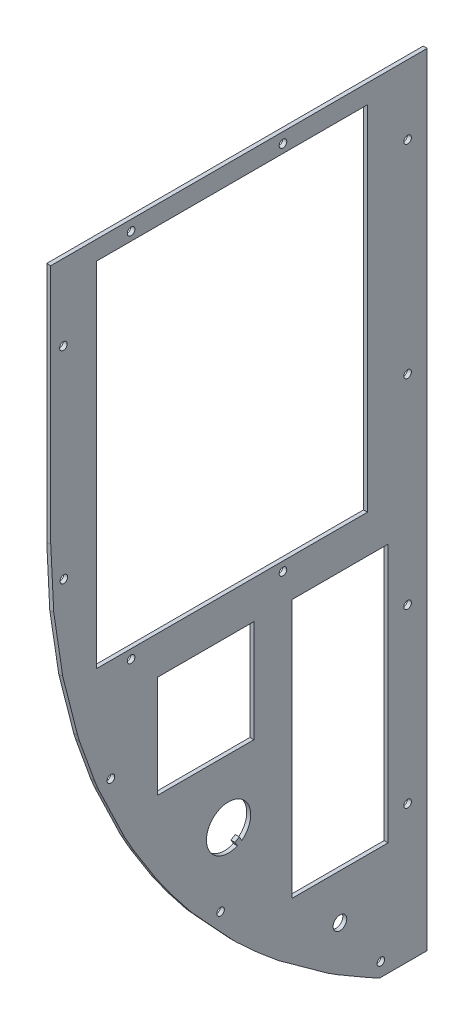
ISO-10303-21;
HEADER;
FILE_DESCRIPTION(('STEP AP214'),'2;1');
FILE_NAME('part.step','',(''),(''),'','','');
FILE_SCHEMA(('AUTOMOTIVE_DESIGN { 1 0 10303 214 1 1 1 1 }'));
ENDSEC;
DATA;
#1=APPLICATION_CONTEXT('core data for automotive mechanical design processes');
#2=APPLICATION_PROTOCOL_DEFINITION('international standard','automotive_design',2000,#1);
#3=PRODUCT_CONTEXT('',#1,'mechanical');
#4=PRODUCT('Part','Part','',(#3));
#5=PRODUCT_RELATED_PRODUCT_CATEGORY('part','',(#4));
#6=PRODUCT_DEFINITION_FORMATION('','',#4);
#7=PRODUCT_DEFINITION_CONTEXT('part definition',#1,'design');
#8=PRODUCT_DEFINITION('design','',#6,#7);
#9=PRODUCT_DEFINITION_SHAPE('','',#8);
#10=(LENGTH_UNIT() NAMED_UNIT(*) SI_UNIT(.MILLI.,.METRE.));
#11=(NAMED_UNIT(*) PLANE_ANGLE_UNIT() SI_UNIT($,.RADIAN.));
#12=(NAMED_UNIT(*) SI_UNIT($,.STERADIAN.) SOLID_ANGLE_UNIT());
#13=UNCERTAINTY_MEASURE_WITH_UNIT(LENGTH_MEASURE(1.E-05),#10,'distance_accuracy_value','');
#14=(GEOMETRIC_REPRESENTATION_CONTEXT(3) GLOBAL_UNCERTAINTY_ASSIGNED_CONTEXT((#13)) GLOBAL_UNIT_ASSIGNED_CONTEXT((#10,
#11,#12)) REPRESENTATION_CONTEXT('',''));
#15=CARTESIAN_POINT('',(0.,0.,0.));
#16=DIRECTION('',(0.,0.,1.));
#17=DIRECTION('',(1.,0.,0.));
#18=AXIS2_PLACEMENT_3D('',#15,#16,#17);
#19=CARTESIAN_POINT('',(909.536268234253,5.00329226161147E-13,797.8332603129));
#20=DIRECTION('',(0.,0.,1.));
#21=DIRECTION('',(0.,-1.,0.));
#22=AXIS2_PLACEMENT_3D('',#19,#20,#21);
#23=PLANE('',#22);
#24=DIRECTION('',(0.,1.,0.));
#25=VECTOR('',#24,1.);
#26=CARTESIAN_POINT('',(907.536268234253,5.00329226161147E-13,797.8332603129));
#27=LINE('',#26,#25);
#28=CARTESIAN_POINT('',(907.536268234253,292.071203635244,797.833260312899));
#29=VERTEX_POINT('',#28);
#30=CARTESIAN_POINT('',(907.536268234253,469.109203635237,797.833260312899));
#31=VERTEX_POINT('',#30);
#32=EDGE_CURVE('E540',#29,#31,#27,.T.);
#33=ORIENTED_EDGE('',*,*,#32,.F.);
#34=DIRECTION('',(-1.,0.,0.));
#35=VECTOR('',#34,1.);
#36=CARTESIAN_POINT('',(909.536268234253,292.071203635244,797.833260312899));
#37=LINE('',#36,#35);
#38=CARTESIAN_POINT('',(909.536268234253,292.071203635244,797.833260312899));
#39=VERTEX_POINT('',#38);
#40=EDGE_CURVE('E11',#39,#29,#37,.T.);
#41=ORIENTED_EDGE('',*,*,#40,.F.);
#42=DIRECTION('',(0.,1.,0.));
#43=VECTOR('',#42,1.);
#44=CARTESIAN_POINT('',(909.536268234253,5.00329226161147E-13,797.8332603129));
#45=LINE('',#44,#43);
#46=CARTESIAN_POINT('',(909.536268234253,469.109203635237,797.833260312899));
#47=VERTEX_POINT('',#46);
#48=EDGE_CURVE('E328',#39,#47,#45,.T.);
#49=ORIENTED_EDGE('',*,*,#48,.T.);
#50=DIRECTION('',(-1.,0.,0.));
#51=VECTOR('',#50,1.);
#52=CARTESIAN_POINT('',(909.536268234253,469.109203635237,797.833260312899));
#53=LINE('',#52,#51);
#54=EDGE_CURVE('E63',#47,#31,#53,.T.);
#55=ORIENTED_EDGE('',*,*,#54,.T.);
#56=EDGE_LOOP('',(#33,#41,#49,#55));
#57=FACE_BOUND('',#56,.T.);
#58=ADVANCED_FACE('F43',(#57),#23,.T.);
#59=CARTESIAN_POINT('',(909.536268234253,292.071203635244,0.));
#60=DIRECTION('',(0.,1.,0.));
#61=DIRECTION('',(0.,0.,1.));
#62=AXIS2_PLACEMENT_3D('',#59,#60,#61);
#63=PLANE('',#62);
#64=DIRECTION('',(0.,0.,-1.));
#65=VECTOR('',#64,1.);
#66=CARTESIAN_POINT('',(907.536268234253,292.071203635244,0.));
#67=LINE('',#66,#65);
#68=CARTESIAN_POINT('',(907.536268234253,292.071203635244,933.723260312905));
#69=VERTEX_POINT('',#68);
#70=EDGE_CURVE('E314',#69,#29,#67,.T.);
#71=ORIENTED_EDGE('',*,*,#70,.F.);
#72=DIRECTION('',(-1.,0.,0.));
#73=VECTOR('',#72,1.);
#74=CARTESIAN_POINT('',(909.536268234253,292.071203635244,933.723260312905));
#75=LINE('',#74,#73);
#76=CARTESIAN_POINT('',(909.536268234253,292.071203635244,933.723260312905));
#77=VERTEX_POINT('',#76);
#78=EDGE_CURVE('E54',#77,#69,#75,.T.);
#79=ORIENTED_EDGE('',*,*,#78,.F.);
#80=DIRECTION('',(0.,0.,-1.));
#81=VECTOR('',#80,1.);
#82=CARTESIAN_POINT('',(909.536268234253,292.071203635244,0.));
#83=LINE('',#82,#81);
#84=EDGE_CURVE('E312',#77,#39,#83,.T.);
#85=ORIENTED_EDGE('',*,*,#84,.T.);
#86=ORIENTED_EDGE('',*,*,#40,.T.);
#87=EDGE_LOOP('',(#71,#79,#85,#86));
#88=FACE_BOUND('',#87,.T.);
#89=ADVANCED_FACE('F310',(#88),#63,.T.);
#90=CARTESIAN_POINT('',(909.536268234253,0.,933.723260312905));
#91=DIRECTION('',(0.,0.,1.));
#92=DIRECTION('',(1.,0.,0.));
#93=AXIS2_PLACEMENT_3D('',#90,#91,#92);
#94=PLANE('',#93);
#95=DIRECTION('',(0.,1.,0.));
#96=VECTOR('',#95,1.);
#97=CARTESIAN_POINT('',(907.536268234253,0.,933.723260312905));
#98=LINE('',#97,#96);
#99=CARTESIAN_POINT('',(907.536268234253,469.109203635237,933.723260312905));
#100=VERTEX_POINT('',#99);
#101=EDGE_CURVE('E545',#69,#100,#98,.T.);
#102=ORIENTED_EDGE('',*,*,#101,.T.);
#103=DIRECTION('',(-1.,0.,0.));
#104=VECTOR('',#103,1.);
#105=CARTESIAN_POINT('',(909.536268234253,469.109203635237,933.723260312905));
#106=LINE('',#105,#104);
#107=CARTESIAN_POINT('',(909.536268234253,469.109203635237,933.723260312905));
#108=VERTEX_POINT('',#107);
#109=EDGE_CURVE('E185',#108,#100,#106,.T.);
#110=ORIENTED_EDGE('',*,*,#109,.F.);
#111=DIRECTION('',(0.,1.,0.));
#112=VECTOR('',#111,1.);
#113=CARTESIAN_POINT('',(909.536268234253,0.,933.723260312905));
#114=LINE('',#113,#112);
#115=EDGE_CURVE('E319',#77,#108,#114,.T.);
#116=ORIENTED_EDGE('',*,*,#115,.F.);
#117=ORIENTED_EDGE('',*,*,#78,.T.);
#118=EDGE_LOOP('',(#102,#110,#116,#117));
#119=FACE_BOUND('',#118,.T.);
#120=ADVANCED_FACE('F320',(#119),#94,.F.);
#121=CARTESIAN_POINT('',(909.536268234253,221.704190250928,0.));
#122=DIRECTION('',(0.,1.,0.));
#123=DIRECTION('',(0.,0.,1.));
#124=AXIS2_PLACEMENT_3D('',#121,#122,#123);
#125=PLANE('',#124);
#126=DIRECTION('',(0.,0.,-1.));
#127=VECTOR('',#126,1.);
#128=CARTESIAN_POINT('',(907.536268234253,221.704190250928,0.));
#129=LINE('',#128,#127);
#130=CARTESIAN_POINT('',(907.536268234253,221.704190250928,903.104984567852));
#131=VERTEX_POINT('',#130);
#132=CARTESIAN_POINT('',(907.536268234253,221.704190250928,854.844984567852));
#133=VERTEX_POINT('',#132);
#134=EDGE_CURVE('E524',#131,#133,#129,.T.);
#135=ORIENTED_EDGE('',*,*,#134,.F.);
#136=DIRECTION('',(-1.,0.,0.));
#137=VECTOR('',#136,1.);
#138=CARTESIAN_POINT('',(909.536268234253,221.704190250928,903.104984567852));
#139=LINE('',#138,#137);
#140=CARTESIAN_POINT('',(909.536268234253,221.704190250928,903.104984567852));
#141=VERTEX_POINT('',#140);
#142=EDGE_CURVE('E555',#141,#131,#139,.T.);
#143=ORIENTED_EDGE('',*,*,#142,.F.);
#144=DIRECTION('',(0.,0.,-1.));
#145=VECTOR('',#144,1.);
#146=CARTESIAN_POINT('',(909.536268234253,221.704190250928,0.));
#147=LINE('',#146,#145);
#148=CARTESIAN_POINT('',(909.536268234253,221.704190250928,854.844984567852));
#149=VERTEX_POINT('',#148);
#150=EDGE_CURVE('E1407',#141,#149,#147,.T.);
#151=ORIENTED_EDGE('',*,*,#150,.T.);
#152=DIRECTION('',(-1.,0.,0.));
#153=VECTOR('',#152,1.);
#154=CARTESIAN_POINT('',(909.536268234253,221.704190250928,854.844984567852));
#155=LINE('',#154,#153);
#156=EDGE_CURVE('E558',#149,#133,#155,.T.);
#157=ORIENTED_EDGE('',*,*,#156,.T.);
#158=EDGE_LOOP('',(#135,#143,#151,#157));
#159=FACE_BOUND('',#158,.T.);
#160=ADVANCED_FACE('F735',(#159),#125,.T.);
#161=CARTESIAN_POINT('',(909.536268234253,0.,903.104984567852));
#162=DIRECTION('',(0.,0.,-1.));
#163=DIRECTION('',(-1.,0.,0.));
#164=AXIS2_PLACEMENT_3D('',#161,#162,#163);
#165=PLANE('',#164);
#166=DIRECTION('',(0.,-1.,0.));
#167=VECTOR('',#166,1.);
#168=CARTESIAN_POINT('',(907.536268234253,0.,903.104984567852));
#169=LINE('',#168,#167);
#170=CARTESIAN_POINT('',(907.536268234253,273.012896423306,903.104984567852));
#171=VERTEX_POINT('',#170);
#172=EDGE_CURVE('E528',#171,#131,#169,.T.);
#173=ORIENTED_EDGE('',*,*,#172,.F.);
#174=DIRECTION('',(-1.,0.,0.));
#175=VECTOR('',#174,1.);
#176=CARTESIAN_POINT('',(909.536268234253,273.012896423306,903.104984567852));
#177=LINE('',#176,#175);
#178=CARTESIAN_POINT('',(909.536268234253,273.012896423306,903.104984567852));
#179=VERTEX_POINT('',#178);
#180=EDGE_CURVE('E565',#179,#171,#177,.T.);
#181=ORIENTED_EDGE('',*,*,#180,.F.);
#182=DIRECTION('',(0.,-1.,0.));
#183=VECTOR('',#182,1.);
#184=CARTESIAN_POINT('',(909.536268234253,0.,903.104984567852));
#185=LINE('',#184,#183);
#186=EDGE_CURVE('E1410',#179,#141,#185,.T.);
#187=ORIENTED_EDGE('',*,*,#186,.T.);
#188=ORIENTED_EDGE('',*,*,#142,.T.);
#189=EDGE_LOOP('',(#173,#181,#187,#188));
#190=FACE_BOUND('',#189,.T.);
#191=ADVANCED_FACE('F731',(#190),#165,.T.);
#192=CARTESIAN_POINT('',(909.536268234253,273.012896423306,0.));
#193=DIRECTION('',(0.,-1.,0.));
#194=DIRECTION('',(0.,0.,-1.));
#195=AXIS2_PLACEMENT_3D('',#192,#193,#194);
#196=PLANE('',#195);
#197=DIRECTION('',(0.,0.,1.));
#198=VECTOR('',#197,1.);
#199=CARTESIAN_POINT('',(907.536268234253,273.012896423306,0.));
#200=LINE('',#199,#198);
#201=CARTESIAN_POINT('',(907.536268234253,273.012896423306,854.844984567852));
#202=VERTEX_POINT('',#201);
#203=EDGE_CURVE('E532',#202,#171,#200,.T.);
#204=ORIENTED_EDGE('',*,*,#203,.F.);
#205=DIRECTION('',(-1.,0.,0.));
#206=VECTOR('',#205,1.);
#207=CARTESIAN_POINT('',(909.536268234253,273.012896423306,854.844984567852));
#208=LINE('',#207,#206);
#209=CARTESIAN_POINT('',(909.536268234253,273.012896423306,854.844984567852));
#210=VERTEX_POINT('',#209);
#211=EDGE_CURVE('E561',#210,#202,#208,.T.);
#212=ORIENTED_EDGE('',*,*,#211,.F.);
#213=DIRECTION('',(0.,0.,1.));
#214=VECTOR('',#213,1.);
#215=CARTESIAN_POINT('',(909.536268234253,273.012896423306,0.));
#216=LINE('',#215,#214);
#217=EDGE_CURVE('E1420',#210,#179,#216,.T.);
#218=ORIENTED_EDGE('',*,*,#217,.T.);
#219=ORIENTED_EDGE('',*,*,#180,.T.);
#220=EDGE_LOOP('',(#204,#212,#218,#219));
#221=FACE_BOUND('',#220,.T.);
#222=ADVANCED_FACE('F727',(#221),#196,.T.);
#223=CARTESIAN_POINT('',(909.536268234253,478.633909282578,1.39472570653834E-13));
#224=DIRECTION('',(0.,1.,0.));
#225=DIRECTION('',(0.,0.,1.));
#226=AXIS2_PLACEMENT_3D('',#223,#224,#225);
#227=PLANE('',#226);
#228=DIRECTION('',(0.,0.,-1.));
#229=VECTOR('',#228,1.);
#230=CARTESIAN_POINT('',(907.536268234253,478.633909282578,1.39472570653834E-13));
#231=LINE('',#230,#229);
#232=CARTESIAN_POINT('',(907.536268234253,478.633909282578,956.76463842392));
#233=VERTEX_POINT('',#232);
#234=CARTESIAN_POINT('',(907.536268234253,478.633909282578,767.871201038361));
#235=VERTEX_POINT('',#234);
#236=EDGE_CURVE('E428',#233,#235,#231,.T.);
#237=ORIENTED_EDGE('',*,*,#236,.F.);
#238=DIRECTION('',(-1.,0.,0.));
#239=VECTOR('',#238,1.);
#240=CARTESIAN_POINT('',(909.536268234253,478.633909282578,956.76463842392));
#241=LINE('',#240,#239);
#242=CARTESIAN_POINT('',(909.536268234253,478.633909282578,956.76463842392));
#243=VERTEX_POINT('',#242);
#244=EDGE_CURVE('E562',#243,#233,#241,.T.);
#245=ORIENTED_EDGE('',*,*,#244,.F.);
#246=DIRECTION('',(0.,0.,-1.));
#247=VECTOR('',#246,1.);
#248=CARTESIAN_POINT('',(909.536268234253,478.633909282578,1.39472570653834E-13));
#249=LINE('',#248,#247);
#250=CARTESIAN_POINT('',(909.536268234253,478.633909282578,767.871201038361));
#251=VERTEX_POINT('',#250);
#252=EDGE_CURVE('E1403',#243,#251,#249,.T.);
#253=ORIENTED_EDGE('',*,*,#252,.T.);
#254=DIRECTION('',(-1.,0.,0.));
#255=VECTOR('',#254,1.);
#256=CARTESIAN_POINT('',(909.536268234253,478.633909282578,767.871201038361));
#257=LINE('',#256,#255);
#258=EDGE_CURVE('E570',#251,#235,#257,.T.);
#259=ORIENTED_EDGE('',*,*,#258,.T.);
#260=EDGE_LOOP('',(#237,#245,#253,#259));
#261=FACE_BOUND('',#260,.T.);
#262=ADVANCED_FACE('F730',(#261),#227,.T.);
#263=CARTESIAN_POINT('',(909.536268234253,0.,956.76463842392));
#264=DIRECTION('',(0.,0.,-1.));
#265=DIRECTION('',(-1.,0.,0.));
#266=AXIS2_PLACEMENT_3D('',#263,#264,#265);
#267=PLANE('',#266);
#268=DIRECTION('',(0.,-1.,0.));
#269=VECTOR('',#268,1.);
#270=CARTESIAN_POINT('',(907.536268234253,0.,956.76463842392));
#271=LINE('',#270,#269);
#272=CARTESIAN_POINT('',(907.536268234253,357.485175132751,956.76463842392));
#273=VERTEX_POINT('',#272);
#274=EDGE_CURVE('E432',#233,#273,#271,.T.);
#275=ORIENTED_EDGE('',*,*,#274,.T.);
#276=DIRECTION('',(-1.,0.,0.));
#277=VECTOR('',#276,1.);
#278=CARTESIAN_POINT('',(909.536268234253,357.485175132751,956.76463842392));
#279=LINE('',#278,#277);
#280=CARTESIAN_POINT('',(909.536268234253,357.485175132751,956.76463842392));
#281=VERTEX_POINT('',#280);
#282=EDGE_CURVE('E658',#281,#273,#279,.T.);
#283=ORIENTED_EDGE('',*,*,#282,.F.);
#284=DIRECTION('',(0.,-1.,0.));
#285=VECTOR('',#284,1.);
#286=CARTESIAN_POINT('',(909.536268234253,0.,956.76463842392));
#287=LINE('',#286,#285);
#288=EDGE_CURVE('E1516',#243,#281,#287,.T.);
#289=ORIENTED_EDGE('',*,*,#288,.F.);
#290=ORIENTED_EDGE('',*,*,#244,.T.);
#291=EDGE_LOOP('',(#275,#283,#289,#290));
#292=FACE_BOUND('',#291,.T.);
#293=ADVANCED_FACE('F828',(#292),#267,.F.);
#294=CARTESIAN_POINT('',(909.536268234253,-46.644325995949,936.639119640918));
#295=DIRECTION('',(0.,0.0497380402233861,-0.998762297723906));
#296=DIRECTION('',(0.,0.998762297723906,0.0497380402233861));
#297=AXIS2_PLACEMENT_3D('',#294,#295,#296);
#298=PLANE('',#297);
#299=DIRECTION('',(0.,-0.998762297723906,-0.0497380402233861));
#300=VECTOR('',#299,1.);
#301=CARTESIAN_POINT('',(907.536268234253,-46.644325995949,936.639119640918));
#302=LINE('',#301,#300);
#303=CARTESIAN_POINT('',(907.536268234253,327.202707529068,955.256581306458));
#304=VERTEX_POINT('',#303);
#305=EDGE_CURVE('E436',#273,#304,#302,.T.);
#306=ORIENTED_EDGE('',*,*,#305,.T.);
#307=DIRECTION('',(-1.,0.,0.));
#308=VECTOR('',#307,1.);
#309=CARTESIAN_POINT('',(909.536268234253,327.202707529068,955.256581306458));
#310=LINE('',#309,#308);
#311=CARTESIAN_POINT('',(909.536268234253,327.202707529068,955.256581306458));
#312=VERTEX_POINT('',#311);
#313=EDGE_CURVE('E654',#312,#304,#310,.T.);
#314=ORIENTED_EDGE('',*,*,#313,.F.);
#315=DIRECTION('',(0.,-0.998762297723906,-0.0497380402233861));
#316=VECTOR('',#315,1.);
#317=CARTESIAN_POINT('',(909.536268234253,-46.644325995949,936.639119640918));
#318=LINE('',#317,#316);
#319=EDGE_CURVE('E1512',#281,#312,#318,.T.);
#320=ORIENTED_EDGE('',*,*,#319,.F.);
#321=ORIENTED_EDGE('',*,*,#282,.T.);
#322=EDGE_LOOP('',(#306,#314,#320,#321));
#323=FACE_BOUND('',#322,.T.);
#324=ADVANCED_FACE('F824',(#323),#298,.F.);
#325=CARTESIAN_POINT('',(909.536268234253,-133.247840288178,886.0089255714));
#326=DIRECTION('',(0.,0.148718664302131,-0.988879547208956));
#327=DIRECTION('',(0.,0.988879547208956,0.148718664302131));
#328=AXIS2_PLACEMENT_3D('',#325,#326,#327);
#329=PLANE('',#328);
#330=DIRECTION('',(0.,-0.988879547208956,-0.148718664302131));
#331=VECTOR('',#330,1.);
#332=CARTESIAN_POINT('',(907.536268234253,-133.247840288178,886.0089255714));
#333=LINE('',#332,#331);
#334=CARTESIAN_POINT('',(907.536268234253,297.21987247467,950.747430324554));
#335=VERTEX_POINT('',#334);
#336=EDGE_CURVE('E440',#304,#335,#333,.T.);
#337=ORIENTED_EDGE('',*,*,#336,.T.);
#338=DIRECTION('',(-1.,0.,0.));
#339=VECTOR('',#338,1.);
#340=CARTESIAN_POINT('',(909.536268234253,297.21987247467,950.747430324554));
#341=LINE('',#340,#339);
#342=CARTESIAN_POINT('',(909.536268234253,297.21987247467,950.747430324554));
#343=VERTEX_POINT('',#342);
#344=EDGE_CURVE('E650',#343,#335,#341,.T.);
#345=ORIENTED_EDGE('',*,*,#344,.F.);
#346=DIRECTION('',(0.,-0.988879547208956,-0.148718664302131));
#347=VECTOR('',#346,1.);
#348=CARTESIAN_POINT('',(909.536268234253,-133.247840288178,886.0089255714));
#349=LINE('',#348,#347);
#350=EDGE_CURVE('E1508',#312,#343,#349,.T.);
#351=ORIENTED_EDGE('',*,*,#350,.F.);
#352=ORIENTED_EDGE('',*,*,#313,.T.);
#353=EDGE_LOOP('',(#337,#345,#351,#352));
#354=FACE_BOUND('',#353,.T.);
#355=ADVANCED_FACE('F820',(#354),#329,.F.);
#356=CARTESIAN_POINT('',(909.536268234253,-208.876727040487,822.171015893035));
#357=DIRECTION('',(0.,0.246232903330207,-0.969210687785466));
#358=DIRECTION('',(0.,0.969210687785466,0.246232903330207));
#359=AXIS2_PLACEMENT_3D('',#356,#357,#358);
#360=PLANE('',#359);
#361=DIRECTION('',(0.,-0.969210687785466,-0.246232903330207));
#362=VECTOR('',#361,1.);
#363=CARTESIAN_POINT('',(907.536268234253,-208.876727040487,822.171015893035));
#364=LINE('',#363,#362);
#365=CARTESIAN_POINT('',(907.536268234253,267.833411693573,943.281650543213));
#366=VERTEX_POINT('',#365);
#367=EDGE_CURVE('E444',#335,#366,#364,.T.);
#368=ORIENTED_EDGE('',*,*,#367,.T.);
#369=DIRECTION('',(-1.,0.,0.));
#370=VECTOR('',#369,1.);
#371=CARTESIAN_POINT('',(909.536268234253,267.833411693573,943.281650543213));
#372=LINE('',#371,#370);
#373=CARTESIAN_POINT('',(909.536268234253,267.833411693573,943.281650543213));
#374=VERTEX_POINT('',#373);
#375=EDGE_CURVE('E646',#374,#366,#372,.T.);
#376=ORIENTED_EDGE('',*,*,#375,.F.);
#377=DIRECTION('',(0.,-0.969210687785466,-0.246232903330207));
#378=VECTOR('',#377,1.);
#379=CARTESIAN_POINT('',(909.536268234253,-208.876727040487,822.171015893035));
#380=LINE('',#379,#378);
#381=EDGE_CURVE('E1504',#343,#374,#380,.T.);
#382=ORIENTED_EDGE('',*,*,#381,.F.);
#383=ORIENTED_EDGE('',*,*,#344,.T.);
#384=EDGE_LOOP('',(#368,#376,#382,#383));
#385=FACE_BOUND('',#384,.T.);
#386=ADVANCED_FACE('F816',(#385),#360,.F.);
#387=CARTESIAN_POINT('',(909.536268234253,-245.286158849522,782.420392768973));
#388=DIRECTION('',(0.,0.299141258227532,-0.954208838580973));
#389=DIRECTION('',(0.,0.954208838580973,0.299141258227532));
#390=AXIS2_PLACEMENT_3D('',#387,#388,#389);
#391=PLANE('',#390);
#392=DIRECTION('',(0.,-0.954208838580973,-0.299141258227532));
#393=VECTOR('',#392,1.);
#394=CARTESIAN_POINT('',(907.536268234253,-245.286158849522,782.420392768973));
#395=LINE('',#394,#393);
#396=CARTESIAN_POINT('',(907.536268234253,264.779567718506,942.32428073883));
#397=VERTEX_POINT('',#396);
#398=EDGE_CURVE('E448',#366,#397,#395,.T.);
#399=ORIENTED_EDGE('',*,*,#398,.T.);
#400=DIRECTION('',(-1.,0.,0.));
#401=VECTOR('',#400,1.);
#402=CARTESIAN_POINT('',(909.536268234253,264.779567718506,942.32428073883));
#403=LINE('',#402,#401);
#404=CARTESIAN_POINT('',(909.536268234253,264.779567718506,942.32428073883));
#405=VERTEX_POINT('',#404);
#406=EDGE_CURVE('E642',#405,#397,#403,.T.);
#407=ORIENTED_EDGE('',*,*,#406,.F.);
#408=DIRECTION('',(0.,-0.954208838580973,-0.299141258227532));
#409=VECTOR('',#408,1.);
#410=CARTESIAN_POINT('',(909.536268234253,-245.286158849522,782.420392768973));
#411=LINE('',#410,#409);
#412=EDGE_CURVE('E1500',#374,#405,#411,.T.);
#413=ORIENTED_EDGE('',*,*,#412,.F.);
#414=ORIENTED_EDGE('',*,*,#375,.T.);
#415=EDGE_LOOP('',(#399,#407,#413,#414));
#416=FACE_BOUND('',#415,.T.);
#417=ADVANCED_FACE('F812',(#416),#391,.F.);
#418=CARTESIAN_POINT('',(909.536268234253,-270.120664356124,749.561415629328));
#419=DIRECTION('',(0.,0.339028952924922,-0.940775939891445));
#420=DIRECTION('',(0.,0.940775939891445,0.339028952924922));
#421=AXIS2_PLACEMENT_3D('',#418,#419,#420);
#422=PLANE('',#421);
#423=DIRECTION('',(0.,-0.940775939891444,-0.339028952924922));
#424=VECTOR('',#423,1.);
#425=CARTESIAN_POINT('',(907.536268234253,-270.120664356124,749.561415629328));
#426=LINE('',#425,#424);
#427=CARTESIAN_POINT('',(907.536268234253,243.659436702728,934.713184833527));
#428=VERTEX_POINT('',#427);
#429=EDGE_CURVE('E452',#397,#428,#426,.T.);
#430=ORIENTED_EDGE('',*,*,#429,.T.);
#431=DIRECTION('',(-1.,0.,0.));
#432=VECTOR('',#431,1.);
#433=CARTESIAN_POINT('',(909.536268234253,243.659436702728,934.713184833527));
#434=LINE('',#433,#432);
#435=CARTESIAN_POINT('',(909.536268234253,243.659436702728,934.713184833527));
#436=VERTEX_POINT('',#435);
#437=EDGE_CURVE('E638',#436,#428,#434,.T.);
#438=ORIENTED_EDGE('',*,*,#437,.F.);
#439=DIRECTION('',(0.,-0.940775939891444,-0.339028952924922));
#440=VECTOR('',#439,1.);
#441=CARTESIAN_POINT('',(909.536268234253,-270.120664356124,749.561415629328));
#442=LINE('',#441,#440);
#443=EDGE_CURVE('E1496',#405,#436,#442,.T.);
#444=ORIENTED_EDGE('',*,*,#443,.F.);
#445=ORIENTED_EDGE('',*,*,#406,.T.);
#446=EDGE_LOOP('',(#430,#438,#444,#445));
#447=FACE_BOUND('',#446,.T.);
#448=ADVANCED_FACE('F808',(#447),#422,.F.);
#449=CARTESIAN_POINT('',(909.536268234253,-293.659117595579,713.595687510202));
#450=DIRECTION('',(0.,0.380556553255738,-0.924757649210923));
#451=DIRECTION('',(0.,0.924757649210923,0.380556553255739));
#452=AXIS2_PLACEMENT_3D('',#449,#450,#451);
#453=PLANE('',#452);
#454=DIRECTION('',(0.,-0.924757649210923,-0.380556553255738));
#455=VECTOR('',#454,1.);
#456=CARTESIAN_POINT('',(907.536268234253,-293.659117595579,713.595687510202));
#457=LINE('',#456,#455);
#458=CARTESIAN_POINT('',(907.536268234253,239.33407664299,932.933211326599));
#459=VERTEX_POINT('',#458);
#460=EDGE_CURVE('E456',#428,#459,#457,.T.);
#461=ORIENTED_EDGE('',*,*,#460,.T.);
#462=DIRECTION('',(-1.,0.,0.));
#463=VECTOR('',#462,1.);
#464=CARTESIAN_POINT('',(909.536268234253,239.33407664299,932.933211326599));
#465=LINE('',#464,#463);
#466=CARTESIAN_POINT('',(909.536268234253,239.33407664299,932.933211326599));
#467=VERTEX_POINT('',#466);
#468=EDGE_CURVE('E634',#467,#459,#465,.T.);
#469=ORIENTED_EDGE('',*,*,#468,.F.);
#470=DIRECTION('',(0.,-0.924757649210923,-0.380556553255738));
#471=VECTOR('',#470,1.);
#472=CARTESIAN_POINT('',(909.536268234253,-293.659117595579,713.595687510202));
#473=LINE('',#472,#471);
#474=EDGE_CURVE('E1492',#436,#467,#473,.T.);
#475=ORIENTED_EDGE('',*,*,#474,.F.);
#476=ORIENTED_EDGE('',*,*,#437,.T.);
#477=EDGE_LOOP('',(#461,#469,#475,#476));
#478=FACE_BOUND('',#477,.T.);
#479=ADVANCED_FACE('F804',(#478),#453,.F.);
#480=CARTESIAN_POINT('',(909.536268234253,-319.255824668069,664.602959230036));
#481=DIRECTION('',(0.,0.433002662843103,-0.901392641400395));
#482=DIRECTION('',(0.,0.901392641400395,0.433002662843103));
#483=AXIS2_PLACEMENT_3D('',#480,#481,#482);
#484=PLANE('',#483);
#485=DIRECTION('',(0.,-0.901392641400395,-0.433002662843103));
#486=VECTOR('',#485,1.);
#487=CARTESIAN_POINT('',(907.536268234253,-319.255824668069,664.602959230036));
#488=LINE('',#487,#486);
#489=CARTESIAN_POINT('',(907.536268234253,212.003856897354,919.804573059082));
#490=VERTEX_POINT('',#489);
#491=EDGE_CURVE('E460',#459,#490,#488,.T.);
#492=ORIENTED_EDGE('',*,*,#491,.T.);
#493=DIRECTION('',(-1.,0.,0.));
#494=VECTOR('',#493,1.);
#495=CARTESIAN_POINT('',(909.536268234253,212.003856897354,919.804573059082));
#496=LINE('',#495,#494);
#497=CARTESIAN_POINT('',(909.536268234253,212.003856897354,919.804573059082));
#498=VERTEX_POINT('',#497);
#499=EDGE_CURVE('E630',#498,#490,#496,.T.);
#500=ORIENTED_EDGE('',*,*,#499,.F.);
#501=DIRECTION('',(0.,-0.901392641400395,-0.433002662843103));
#502=VECTOR('',#501,1.);
#503=CARTESIAN_POINT('',(909.536268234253,-319.255824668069,664.602959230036));
#504=LINE('',#503,#502);
#505=EDGE_CURVE('E1488',#467,#498,#504,.T.);
#506=ORIENTED_EDGE('',*,*,#505,.F.);
#507=ORIENTED_EDGE('',*,*,#468,.T.);
#508=EDGE_LOOP('',(#492,#500,#506,#507));
#509=FACE_BOUND('',#508,.T.);
#510=ADVANCED_FACE('F800',(#509),#484,.F.);
#511=CARTESIAN_POINT('',(909.536268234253,-342.50027960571,606.845443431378));
#512=DIRECTION('',(0.,0.491514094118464,-0.870869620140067));
#513=DIRECTION('',(0.,0.870869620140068,0.491514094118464));
#514=AXIS2_PLACEMENT_3D('',#511,#512,#513);
#515=PLANE('',#514);
#516=DIRECTION('',(0.,-0.870869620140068,-0.491514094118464));
#517=VECTOR('',#516,1.);
#518=CARTESIAN_POINT('',(907.536268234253,-342.50027960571,606.845443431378));
#519=LINE('',#518,#517);
#520=CARTESIAN_POINT('',(907.536268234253,203.378736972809,914.936602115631));
#521=VERTEX_POINT('',#520);
#522=EDGE_CURVE('E464',#490,#521,#519,.T.);
#523=ORIENTED_EDGE('',*,*,#522,.T.);
#524=DIRECTION('',(-1.,0.,0.));
#525=VECTOR('',#524,1.);
#526=CARTESIAN_POINT('',(909.536268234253,203.378736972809,914.936602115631));
#527=LINE('',#526,#525);
#528=CARTESIAN_POINT('',(909.536268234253,203.378736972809,914.936602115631));
#529=VERTEX_POINT('',#528);
#530=EDGE_CURVE('E626',#529,#521,#527,.T.);
#531=ORIENTED_EDGE('',*,*,#530,.F.);
#532=DIRECTION('',(0.,-0.870869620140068,-0.491514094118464));
#533=VECTOR('',#532,1.);
#534=CARTESIAN_POINT('',(909.536268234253,-342.50027960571,606.845443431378));
#535=LINE('',#534,#533);
#536=EDGE_CURVE('E1484',#498,#529,#535,.T.);
#537=ORIENTED_EDGE('',*,*,#536,.F.);
#538=ORIENTED_EDGE('',*,*,#499,.T.);
#539=EDGE_LOOP('',(#523,#531,#537,#538));
#540=FACE_BOUND('',#539,.T.);
#541=ADVANCED_FACE('F796',(#540),#515,.F.);
#542=CARTESIAN_POINT('',(909.536268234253,-355.143640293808,561.974646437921));
#543=DIRECTION('',(0.,0.534221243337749,-0.845344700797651));
#544=DIRECTION('',(0.,0.845344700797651,0.534221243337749));
#545=AXIS2_PLACEMENT_3D('',#542,#543,#544);
#546=PLANE('',#545);
#547=DIRECTION('',(0.,-0.845344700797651,-0.534221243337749));
#548=VECTOR('',#547,1.);
#549=CARTESIAN_POINT('',(907.536268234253,-355.143640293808,561.974646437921));
#550=LINE('',#549,#548);
#551=CARTESIAN_POINT('',(907.536268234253,186.113238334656,904.025554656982));
#552=VERTEX_POINT('',#551);
#553=EDGE_CURVE('E468',#521,#552,#550,.T.);
#554=ORIENTED_EDGE('',*,*,#553,.T.);
#555=DIRECTION('',(-1.,0.,0.));
#556=VECTOR('',#555,1.);
#557=CARTESIAN_POINT('',(909.536268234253,186.113238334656,904.025554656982));
#558=LINE('',#557,#556);
#559=CARTESIAN_POINT('',(909.536268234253,186.113238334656,904.025554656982));
#560=VERTEX_POINT('',#559);
#561=EDGE_CURVE('E622',#560,#552,#558,.T.);
#562=ORIENTED_EDGE('',*,*,#561,.F.);
#563=DIRECTION('',(0.,-0.845344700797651,-0.534221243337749));
#564=VECTOR('',#563,1.);
#565=CARTESIAN_POINT('',(909.536268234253,-355.143640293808,561.974646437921));
#566=LINE('',#565,#564);
#567=EDGE_CURVE('E1480',#529,#560,#566,.T.);
#568=ORIENTED_EDGE('',*,*,#567,.F.);
#569=ORIENTED_EDGE('',*,*,#530,.T.);
#570=EDGE_LOOP('',(#554,#562,#568,#569));
#571=FACE_BOUND('',#570,.T.);
#572=ADVANCED_FACE('F792',(#571),#546,.F.);
#573=CARTESIAN_POINT('',(909.536268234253,-364.545760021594,511.805316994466));
#574=DIRECTION('',(0.,0.580152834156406,-0.814507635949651));
#575=DIRECTION('',(0.,0.814507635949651,0.580152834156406));
#576=AXIS2_PLACEMENT_3D('',#573,#574,#575);
#577=PLANE('',#576);
#578=DIRECTION('',(0.,-0.814507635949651,-0.580152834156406));
#579=VECTOR('',#578,1.);
#580=CARTESIAN_POINT('',(907.536268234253,-364.545760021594,511.805316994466));
#581=LINE('',#580,#579);
#582=CARTESIAN_POINT('',(907.536268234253,175.280332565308,896.309554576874));
#583=VERTEX_POINT('',#582);
#584=EDGE_CURVE('E472',#552,#583,#581,.T.);
#585=ORIENTED_EDGE('',*,*,#584,.T.);
#586=DIRECTION('',(-1.,0.,0.));
#587=VECTOR('',#586,1.);
#588=CARTESIAN_POINT('',(909.536268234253,175.280332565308,896.309554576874));
#589=LINE('',#588,#587);
#590=CARTESIAN_POINT('',(909.536268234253,175.280332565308,896.309554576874));
#591=VERTEX_POINT('',#590);
#592=EDGE_CURVE('E618',#591,#583,#589,.T.);
#593=ORIENTED_EDGE('',*,*,#592,.F.);
#594=DIRECTION('',(0.,-0.814507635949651,-0.580152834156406));
#595=VECTOR('',#594,1.);
#596=CARTESIAN_POINT('',(909.536268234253,-364.545760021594,511.805316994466));
#597=LINE('',#596,#595);
#598=EDGE_CURVE('E1476',#560,#591,#597,.T.);
#599=ORIENTED_EDGE('',*,*,#598,.F.);
#600=ORIENTED_EDGE('',*,*,#561,.T.);
#601=EDGE_LOOP('',(#585,#593,#599,#600));
#602=FACE_BOUND('',#601,.T.);
#603=ADVANCED_FACE('F788',(#602),#577,.F.);
#604=CARTESIAN_POINT('',(909.536268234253,-368.480069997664,470.014173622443));
#605=DIRECTION('',(0.,0.616975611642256,-0.786982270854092));
#606=DIRECTION('',(0.,0.786982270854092,0.616975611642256));
#607=AXIS2_PLACEMENT_3D('',#604,#605,#606);
#608=PLANE('',#607);
#609=DIRECTION('',(0.,-0.786982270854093,-0.616975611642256));
#610=VECTOR('',#609,1.);
#611=CARTESIAN_POINT('',(907.536268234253,-368.480069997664,470.014173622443));
#612=LINE('',#611,#610);
#613=CARTESIAN_POINT('',(907.536268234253,163.690835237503,887.223660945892));
#614=VERTEX_POINT('',#613);
#615=EDGE_CURVE('E476',#583,#614,#612,.T.);
#616=ORIENTED_EDGE('',*,*,#615,.T.);
#617=DIRECTION('',(-1.,0.,0.));
#618=VECTOR('',#617,1.);
#619=CARTESIAN_POINT('',(909.536268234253,163.690835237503,887.223660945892));
#620=LINE('',#619,#618);
#621=CARTESIAN_POINT('',(909.536268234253,163.690835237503,887.223660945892));
#622=VERTEX_POINT('',#621);
#623=EDGE_CURVE('E614',#622,#614,#620,.T.);
#624=ORIENTED_EDGE('',*,*,#623,.F.);
#625=DIRECTION('',(0.,-0.786982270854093,-0.616975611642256));
#626=VECTOR('',#625,1.);
#627=CARTESIAN_POINT('',(909.536268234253,-368.480069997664,470.014173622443));
#628=LINE('',#627,#626);
#629=EDGE_CURVE('E1472',#591,#622,#628,.T.);
#630=ORIENTED_EDGE('',*,*,#629,.F.);
#631=ORIENTED_EDGE('',*,*,#592,.T.);
#632=EDGE_LOOP('',(#616,#624,#630,#631));
#633=FACE_BOUND('',#632,.T.);
#634=ADVANCED_FACE('F784',(#633),#608,.F.);
#635=CARTESIAN_POINT('',(909.536268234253,-369.251759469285,444.822344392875));
#636=DIRECTION('',(0.,0.638719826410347,-0.769439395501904));
#637=DIRECTION('',(0.,0.769439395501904,0.638719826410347));
#638=AXIS2_PLACEMENT_3D('',#635,#636,#637);
#639=PLANE('',#638);
#640=DIRECTION('',(0.,-0.769439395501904,-0.638719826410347));
#641=VECTOR('',#640,1.);
#642=CARTESIAN_POINT('',(907.536268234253,-369.251759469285,444.822344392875));
#643=LINE('',#642,#641);
#644=CARTESIAN_POINT('',(907.536268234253,161.918371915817,885.752320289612));
#645=VERTEX_POINT('',#644);
#646=EDGE_CURVE('E480',#614,#645,#643,.T.);
#647=ORIENTED_EDGE('',*,*,#646,.T.);
#648=DIRECTION('',(-1.,0.,0.));
#649=VECTOR('',#648,1.);
#650=CARTESIAN_POINT('',(909.536268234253,161.918371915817,885.752320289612));
#651=LINE('',#650,#649);
#652=CARTESIAN_POINT('',(909.536268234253,161.918371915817,885.752320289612));
#653=VERTEX_POINT('',#652);
#654=EDGE_CURVE('E610',#653,#645,#651,.T.);
#655=ORIENTED_EDGE('',*,*,#654,.F.);
#656=DIRECTION('',(0.,-0.769439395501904,-0.638719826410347));
#657=VECTOR('',#656,1.);
#658=CARTESIAN_POINT('',(909.536268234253,-369.251759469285,444.822344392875));
#659=LINE('',#658,#657);
#660=EDGE_CURVE('E1468',#622,#653,#659,.T.);
#661=ORIENTED_EDGE('',*,*,#660,.F.);
#662=ORIENTED_EDGE('',*,*,#623,.T.);
#663=EDGE_LOOP('',(#647,#655,#661,#662));
#664=FACE_BOUND('',#663,.T.);
#665=ADVANCED_FACE('F780',(#664),#639,.F.);
#666=CARTESIAN_POINT('',(909.536268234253,-366.881406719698,396.697306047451));
#667=DIRECTION('',(0.,0.678978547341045,-0.734158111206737));
#668=DIRECTION('',(0.,0.734158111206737,0.678978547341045));
#669=AXIS2_PLACEMENT_3D('',#666,#667,#668);
#670=PLANE('',#669);
#671=DIRECTION('',(0.,-0.734158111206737,-0.678978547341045));
#672=VECTOR('',#671,1.);
#673=CARTESIAN_POINT('',(907.536268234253,-366.881406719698,396.697306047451));
#674=LINE('',#673,#672);
#675=CARTESIAN_POINT('',(907.536268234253,139.658719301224,865.165710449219));
#676=VERTEX_POINT('',#675);
#677=EDGE_CURVE('E484',#645,#676,#674,.T.);
#678=ORIENTED_EDGE('',*,*,#677,.T.);
#679=DIRECTION('',(-1.,0.,0.));
#680=VECTOR('',#679,1.);
#681=CARTESIAN_POINT('',(909.536268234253,139.658719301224,865.165710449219));
#682=LINE('',#681,#680);
#683=CARTESIAN_POINT('',(909.536268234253,139.658719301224,865.165710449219));
#684=VERTEX_POINT('',#683);
#685=EDGE_CURVE('E606',#684,#676,#682,.T.);
#686=ORIENTED_EDGE('',*,*,#685,.F.);
#687=DIRECTION('',(0.,-0.734158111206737,-0.678978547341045));
#688=VECTOR('',#687,1.);
#689=CARTESIAN_POINT('',(909.536268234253,-366.881406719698,396.697306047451));
#690=LINE('',#689,#688);
#691=EDGE_CURVE('E1464',#653,#684,#690,.T.);
#692=ORIENTED_EDGE('',*,*,#691,.F.);
#693=ORIENTED_EDGE('',*,*,#654,.T.);
#694=EDGE_LOOP('',(#678,#686,#692,#693));
#695=FACE_BOUND('',#694,.T.);
#696=ADVANCED_FACE('F776',(#695),#670,.F.);
#697=CARTESIAN_POINT('',(909.536268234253,-360.558597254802,350.301188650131));
#698=DIRECTION('',(0.,0.717235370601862,-0.696830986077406));
#699=DIRECTION('',(0.,0.696830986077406,0.717235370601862));
#700=AXIS2_PLACEMENT_3D('',#697,#698,#699);
#701=PLANE('',#700);
#702=DIRECTION('',(0.,-0.696830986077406,-0.717235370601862));
#703=VECTOR('',#702,1.);
#704=CARTESIAN_POINT('',(907.536268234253,-360.558597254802,350.301188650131));
#705=LINE('',#704,#703);
#706=CARTESIAN_POINT('',(907.536268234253,138.095408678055,863.556623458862));
#707=VERTEX_POINT('',#706);
#708=EDGE_CURVE('E488',#676,#707,#705,.T.);
#709=ORIENTED_EDGE('',*,*,#708,.T.);
#710=DIRECTION('',(-1.,0.,0.));
#711=VECTOR('',#710,1.);
#712=CARTESIAN_POINT('',(909.536268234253,138.095408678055,863.556623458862));
#713=LINE('',#712,#711);
#714=CARTESIAN_POINT('',(909.536268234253,138.095408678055,863.556623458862));
#715=VERTEX_POINT('',#714);
#716=EDGE_CURVE('E602',#715,#707,#713,.T.);
#717=ORIENTED_EDGE('',*,*,#716,.F.);
#718=DIRECTION('',(0.,-0.696830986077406,-0.717235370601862));
#719=VECTOR('',#718,1.);
#720=CARTESIAN_POINT('',(909.536268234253,-360.558597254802,350.301188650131));
#721=LINE('',#720,#719);
#722=EDGE_CURVE('E1460',#684,#715,#721,.T.);
#723=ORIENTED_EDGE('',*,*,#722,.F.);
#724=ORIENTED_EDGE('',*,*,#685,.T.);
#725=EDGE_LOOP('',(#709,#717,#723,#724));
#726=FACE_BOUND('',#725,.T.);
#727=ADVANCED_FACE('F772',(#726),#701,.F.);
#728=CARTESIAN_POINT('',(909.536268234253,-355.506519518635,327.117875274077));
#729=DIRECTION('',(0.,0.735877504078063,-0.677114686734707));
#730=DIRECTION('',(0.,0.677114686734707,0.735877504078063));
#731=AXIS2_PLACEMENT_3D('',#728,#729,#730);
#732=PLANE('',#731);
#733=DIRECTION('',(0.,-0.677114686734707,-0.735877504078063));
#734=VECTOR('',#733,1.);
#735=CARTESIAN_POINT('',(907.536268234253,-355.506519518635,327.117875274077));
#736=LINE('',#735,#734);
#737=CARTESIAN_POINT('',(907.536268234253,128.406167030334,853.026509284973));
#738=VERTEX_POINT('',#737);
#739=EDGE_CURVE('E492',#707,#738,#736,.T.);
#740=ORIENTED_EDGE('',*,*,#739,.T.);
#741=DIRECTION('',(-1.,0.,0.));
#742=VECTOR('',#741,1.);
#743=CARTESIAN_POINT('',(909.536268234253,128.406167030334,853.026509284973));
#744=LINE('',#743,#742);
#745=CARTESIAN_POINT('',(909.536268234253,128.406167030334,853.026509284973));
#746=VERTEX_POINT('',#745);
#747=EDGE_CURVE('E598',#746,#738,#744,.T.);
#748=ORIENTED_EDGE('',*,*,#747,.F.);
#749=DIRECTION('',(0.,-0.677114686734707,-0.735877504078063));
#750=VECTOR('',#749,1.);
#751=CARTESIAN_POINT('',(909.536268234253,-355.506519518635,327.117875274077));
#752=LINE('',#751,#750);
#753=EDGE_CURVE('E1456',#715,#746,#752,.T.);
#754=ORIENTED_EDGE('',*,*,#753,.F.);
#755=ORIENTED_EDGE('',*,*,#716,.T.);
#756=EDGE_LOOP('',(#740,#748,#754,#755));
#757=FACE_BOUND('',#756,.T.);
#758=ADVANCED_FACE('F768',(#757),#732,.F.);
#759=CARTESIAN_POINT('',(909.536268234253,-344.576658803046,288.909785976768));
#760=DIRECTION('',(0.,0.766290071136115,-0.642494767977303));
#761=DIRECTION('',(0.,0.642494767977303,0.766290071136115));
#762=AXIS2_PLACEMENT_3D('',#759,#760,#761);
#763=PLANE('',#762);
#764=DIRECTION('',(0.,-0.642494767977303,-0.766290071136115));
#765=VECTOR('',#764,1.);
#766=CARTESIAN_POINT('',(907.536268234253,-344.576658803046,288.909785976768));
#767=LINE('',#766,#765);
#768=CARTESIAN_POINT('',(907.536268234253,119.55451965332,842.469334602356));
#769=VERTEX_POINT('',#768);
#770=EDGE_CURVE('E496',#738,#769,#767,.T.);
#771=ORIENTED_EDGE('',*,*,#770,.T.);
#772=DIRECTION('',(-1.,0.,0.));
#773=VECTOR('',#772,1.);
#774=CARTESIAN_POINT('',(909.536268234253,119.55451965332,842.469334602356));
#775=LINE('',#774,#773);
#776=CARTESIAN_POINT('',(909.536268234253,119.55451965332,842.469334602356));
#777=VERTEX_POINT('',#776);
#778=EDGE_CURVE('E594',#777,#769,#775,.T.);
#779=ORIENTED_EDGE('',*,*,#778,.F.);
#780=DIRECTION('',(0.,-0.642494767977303,-0.766290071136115));
#781=VECTOR('',#780,1.);
#782=CARTESIAN_POINT('',(909.536268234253,-344.576658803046,288.909785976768));
#783=LINE('',#782,#781);
#784=EDGE_CURVE('E1452',#746,#777,#783,.T.);
#785=ORIENTED_EDGE('',*,*,#784,.F.);
#786=ORIENTED_EDGE('',*,*,#747,.T.);
#787=EDGE_LOOP('',(#771,#779,#785,#786));
#788=FACE_BOUND('',#787,.T.);
#789=ADVANCED_FACE('F764',(#788),#763,.F.);
#790=CARTESIAN_POINT('',(909.536268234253,-321.26817874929,231.982614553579));
#791=DIRECTION('',(0.,0.810732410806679,-0.58541690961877));
#792=DIRECTION('',(0.,0.58541690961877,0.810732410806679));
#793=AXIS2_PLACEMENT_3D('',#790,#791,#792);
#794=PLANE('',#793);
#795=DIRECTION('',(0.,-0.58541690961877,-0.810732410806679));
#796=VECTOR('',#795,1.);
#797=CARTESIAN_POINT('',(907.536268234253,-321.26817874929,231.982614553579));
#798=LINE('',#797,#796);
#799=CARTESIAN_POINT('',(907.536268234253,101.804703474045,817.887961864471));
#800=VERTEX_POINT('',#799);
#801=EDGE_CURVE('E500',#769,#800,#798,.T.);
#802=ORIENTED_EDGE('',*,*,#801,.T.);
#803=DIRECTION('',(-1.,0.,0.));
#804=VECTOR('',#803,1.);
#805=CARTESIAN_POINT('',(909.536268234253,101.804703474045,817.887961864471));
#806=LINE('',#805,#804);
#807=CARTESIAN_POINT('',(909.536268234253,101.804703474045,817.887961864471));
#808=VERTEX_POINT('',#807);
#809=EDGE_CURVE('E590',#808,#800,#806,.T.);
#810=ORIENTED_EDGE('',*,*,#809,.F.);
#811=DIRECTION('',(0.,-0.58541690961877,-0.810732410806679));
#812=VECTOR('',#811,1.);
#813=CARTESIAN_POINT('',(909.536268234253,-321.26817874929,231.982614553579));
#814=LINE('',#813,#812);
#815=EDGE_CURVE('E1448',#777,#808,#814,.T.);
#816=ORIENTED_EDGE('',*,*,#815,.F.);
#817=ORIENTED_EDGE('',*,*,#778,.T.);
#818=EDGE_LOOP('',(#802,#810,#816,#817));
#819=FACE_BOUND('',#818,.T.);
#820=ADVANCED_FACE('F760',(#819),#794,.F.);
#821=CARTESIAN_POINT('',(909.536268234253,-297.472805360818,188.805436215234));
#822=DIRECTION('',(0.,0.844297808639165,-0.535874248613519));
#823=DIRECTION('',(0.,0.535874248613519,0.844297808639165));
#824=AXIS2_PLACEMENT_3D('',#821,#822,#823);
#825=PLANE('',#824);
#826=DIRECTION('',(0.,-0.535874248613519,-0.844297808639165));
#827=VECTOR('',#826,1.);
#828=CARTESIAN_POINT('',(907.536268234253,-297.472805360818,188.805436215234));
#829=LINE('',#828,#827);
#830=CARTESIAN_POINT('',(907.536268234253,98.5080003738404,812.69383430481));
#831=VERTEX_POINT('',#830);
#832=EDGE_CURVE('E504',#800,#831,#829,.T.);
#833=ORIENTED_EDGE('',*,*,#832,.T.);
#834=DIRECTION('',(-1.,0.,0.));
#835=VECTOR('',#834,1.);
#836=CARTESIAN_POINT('',(909.536268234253,98.5080003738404,812.69383430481));
#837=LINE('',#836,#835);
#838=CARTESIAN_POINT('',(909.536268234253,98.5080003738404,812.69383430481));
#839=VERTEX_POINT('',#838);
#840=EDGE_CURVE('E586',#839,#831,#837,.T.);
#841=ORIENTED_EDGE('',*,*,#840,.F.);
#842=DIRECTION('',(0.,-0.535874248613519,-0.844297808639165));
#843=VECTOR('',#842,1.);
#844=CARTESIAN_POINT('',(909.536268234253,-297.472805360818,188.805436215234));
#845=LINE('',#844,#843);
#846=EDGE_CURVE('E1444',#808,#839,#845,.T.);
#847=ORIENTED_EDGE('',*,*,#846,.F.);
#848=ORIENTED_EDGE('',*,*,#809,.T.);
#849=EDGE_LOOP('',(#833,#841,#847,#848));
#850=FACE_BOUND('',#849,.T.);
#851=ADVANCED_FACE('F756',(#850),#825,.F.);
#852=CARTESIAN_POINT('',(909.536268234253,-278.764434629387,161.504763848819));
#853=DIRECTION('',(0.,0.865271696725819,-0.501303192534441));
#854=DIRECTION('',(0.,0.501303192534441,0.865271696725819));
#855=AXIS2_PLACEMENT_3D('',#852,#853,#854);
#856=PLANE('',#855);
#857=DIRECTION('',(0.,-0.501303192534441,-0.865271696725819));
#858=VECTOR('',#857,1.);
#859=CARTESIAN_POINT('',(907.536268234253,-278.764434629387,161.504763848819));
#860=LINE('',#859,#858);
#861=CARTESIAN_POINT('',(907.536268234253,89.2355740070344,796.689212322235));
#862=VERTEX_POINT('',#861);
#863=EDGE_CURVE('E508',#831,#862,#860,.T.);
#864=ORIENTED_EDGE('',*,*,#863,.T.);
#865=DIRECTION('',(-1.,0.,0.));
#866=VECTOR('',#865,1.);
#867=CARTESIAN_POINT('',(909.536268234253,89.2355740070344,796.689212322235));
#868=LINE('',#867,#866);
#869=CARTESIAN_POINT('',(909.536268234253,89.2355740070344,796.689212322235));
#870=VERTEX_POINT('',#869);
#871=EDGE_CURVE('E582',#870,#862,#868,.T.);
#872=ORIENTED_EDGE('',*,*,#871,.F.);
#873=DIRECTION('',(0.,-0.501303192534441,-0.865271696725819));
#874=VECTOR('',#873,1.);
#875=CARTESIAN_POINT('',(909.536268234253,-278.764434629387,161.504763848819));
#876=LINE('',#875,#874);
#877=EDGE_CURVE('E1440',#839,#870,#876,.T.);
#878=ORIENTED_EDGE('',*,*,#877,.F.);
#879=ORIENTED_EDGE('',*,*,#840,.T.);
#880=EDGE_LOOP('',(#864,#872,#878,#879));
#881=FACE_BOUND('',#880,.T.);
#882=ADVANCED_FACE('F752',(#881),#856,.F.);
#883=CARTESIAN_POINT('',(909.536268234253,-258.97906849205,136.623148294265));
#884=DIRECTION('',(0.,0.884469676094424,-0.466597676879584));
#885=DIRECTION('',(0.,0.466597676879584,0.884469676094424));
#886=AXIS2_PLACEMENT_3D('',#883,#884,#885);
#887=PLANE('',#886);
#888=DIRECTION('',(0.,-0.466597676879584,-0.884469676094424));
#889=VECTOR('',#888,1.);
#890=CARTESIAN_POINT('',(907.536268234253,-258.97906849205,136.623148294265));
#891=LINE('',#890,#889);
#892=CARTESIAN_POINT('',(907.536268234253,86.5848958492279,791.664659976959));
#893=VERTEX_POINT('',#892);
#894=EDGE_CURVE('E512',#862,#893,#891,.T.);
#895=ORIENTED_EDGE('',*,*,#894,.T.);
#896=DIRECTION('',(-1.,0.,0.));
#897=VECTOR('',#896,1.);
#898=CARTESIAN_POINT('',(909.536268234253,86.5848958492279,791.664659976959));
#899=LINE('',#898,#897);
#900=CARTESIAN_POINT('',(909.536268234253,86.5848958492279,791.664659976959));
#901=VERTEX_POINT('',#900);
#902=EDGE_CURVE('E578',#901,#893,#899,.T.);
#903=ORIENTED_EDGE('',*,*,#902,.F.);
#904=DIRECTION('',(0.,-0.466597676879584,-0.884469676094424));
#905=VECTOR('',#904,1.);
#906=CARTESIAN_POINT('',(909.536268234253,-258.97906849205,136.623148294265));
#907=LINE('',#906,#905);
#908=EDGE_CURVE('E1436',#870,#901,#907,.T.);
#909=ORIENTED_EDGE('',*,*,#908,.F.);
#910=ORIENTED_EDGE('',*,*,#871,.T.);
#911=EDGE_LOOP('',(#895,#903,#909,#910));
#912=FACE_BOUND('',#911,.T.);
#913=ADVANCED_FACE('F748',(#912),#887,.F.);
#914=CARTESIAN_POINT('',(909.536268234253,86.5848958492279,0.));
#915=DIRECTION('',(0.,1.,0.));
#916=DIRECTION('',(0.,0.,1.));
#917=AXIS2_PLACEMENT_3D('',#914,#915,#916);
#918=PLANE('',#917);
#919=DIRECTION('',(0.,0.,-1.));
#920=VECTOR('',#919,1.);
#921=CARTESIAN_POINT('',(907.536268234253,86.5848958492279,0.));
#922=LINE('',#921,#920);
#923=CARTESIAN_POINT('',(907.536268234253,86.5848958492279,767.871201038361));
#924=VERTEX_POINT('',#923);
#925=EDGE_CURVE('E516',#893,#924,#922,.T.);
#926=ORIENTED_EDGE('',*,*,#925,.T.);
#927=DIRECTION('',(-1.,0.,0.));
#928=VECTOR('',#927,1.);
#929=CARTESIAN_POINT('',(909.536268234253,86.5848958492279,767.871201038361));
#930=LINE('',#929,#928);
#931=CARTESIAN_POINT('',(909.536268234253,86.5848958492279,767.871201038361));
#932=VERTEX_POINT('',#931);
#933=EDGE_CURVE('E573',#932,#924,#930,.T.);
#934=ORIENTED_EDGE('',*,*,#933,.F.);
#935=DIRECTION('',(0.,0.,-1.));
#936=VECTOR('',#935,1.);
#937=CARTESIAN_POINT('',(909.536268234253,86.5848958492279,0.));
#938=LINE('',#937,#936);
#939=EDGE_CURVE('E1432',#901,#932,#938,.T.);
#940=ORIENTED_EDGE('',*,*,#939,.F.);
#941=ORIENTED_EDGE('',*,*,#902,.T.);
#942=EDGE_LOOP('',(#926,#934,#940,#941));
#943=FACE_BOUND('',#942,.T.);
#944=ADVANCED_FACE('F744',(#943),#918,.F.);
#945=CARTESIAN_POINT('',(909.536268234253,0.,787.515686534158));
#946=DIRECTION('',(0.,0.,1.));
#947=DIRECTION('',(1.,0.,0.));
#948=AXIS2_PLACEMENT_3D('',#945,#946,#947);
#949=PLANE('',#948);
#950=DIRECTION('',(0.,1.,0.));
#951=VECTOR('',#950,1.);
#952=CARTESIAN_POINT('',(907.536268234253,0.,787.515686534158));
#953=LINE('',#952,#951);
#954=CARTESIAN_POINT('',(907.536268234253,143.227359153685,787.515686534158));
#955=VERTEX_POINT('',#954);
#956=CARTESIAN_POINT('',(907.536268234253,273.021377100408,787.515686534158));
#957=VERTEX_POINT('',#956);
#958=EDGE_CURVE('E412',#955,#957,#953,.T.);
#959=ORIENTED_EDGE('',*,*,#958,.F.);
#960=DIRECTION('',(-1.,0.,0.));
#961=VECTOR('',#960,1.);
#962=CARTESIAN_POINT('',(909.536268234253,143.227359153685,787.515686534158));
#963=LINE('',#962,#961);
#964=CARTESIAN_POINT('',(909.536268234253,143.227359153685,787.515686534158));
#965=VERTEX_POINT('',#964);
#966=EDGE_CURVE('E574',#965,#955,#963,.T.);
#967=ORIENTED_EDGE('',*,*,#966,.F.);
#968=DIRECTION('',(0.,1.,0.));
#969=VECTOR('',#968,1.);
#970=CARTESIAN_POINT('',(909.536268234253,0.,787.515686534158));
#971=LINE('',#970,#969);
#972=CARTESIAN_POINT('',(909.536268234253,273.021377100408,787.515686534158));
#973=VERTEX_POINT('',#972);
#974=EDGE_CURVE('E1397',#965,#973,#971,.T.);
#975=ORIENTED_EDGE('',*,*,#974,.T.);
#976=DIRECTION('',(-1.,0.,0.));
#977=VECTOR('',#976,1.);
#978=CARTESIAN_POINT('',(909.536268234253,273.021377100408,787.515686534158));
#979=LINE('',#978,#977);
#980=EDGE_CURVE('E664',#973,#957,#979,.T.);
#981=ORIENTED_EDGE('',*,*,#980,.T.);
#982=EDGE_LOOP('',(#959,#967,#975,#981));
#983=FACE_BOUND('',#982,.T.);
#984=ADVANCED_FACE('F747',(#983),#949,.T.);
#985=CARTESIAN_POINT('',(909.536268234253,143.227359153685,0.));
#986=DIRECTION('',(0.,1.,0.));
#987=DIRECTION('',(0.,0.,1.));
#988=AXIS2_PLACEMENT_3D('',#985,#986,#987);
#989=PLANE('',#988);
#990=DIRECTION('',(0.,0.,-1.));
#991=VECTOR('',#990,1.);
#992=CARTESIAN_POINT('',(907.536268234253,143.227359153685,0.));
#993=LINE('',#992,#991);
#994=CARTESIAN_POINT('',(907.536268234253,143.227359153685,835.798900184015));
#995=VERTEX_POINT('',#994);
#996=EDGE_CURVE('E416',#995,#955,#993,.T.);
#997=ORIENTED_EDGE('',*,*,#996,.F.);
#998=DIRECTION('',(-1.,0.,0.));
#999=VECTOR('',#998,1.);
#1000=CARTESIAN_POINT('',(909.536268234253,143.227359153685,835.798900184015));
#1001=LINE('',#1000,#999);
#1002=CARTESIAN_POINT('',(909.536268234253,143.227359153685,835.798900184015));
#1003=VERTEX_POINT('',#1002);
#1004=EDGE_CURVE('E671',#1003,#995,#1001,.T.);
#1005=ORIENTED_EDGE('',*,*,#1004,.F.);
#1006=DIRECTION('',(0.,0.,-1.));
#1007=VECTOR('',#1006,1.);
#1008=CARTESIAN_POINT('',(909.536268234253,143.227359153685,0.));
#1009=LINE('',#1008,#1007);
#1010=EDGE_CURVE('E1528',#1003,#965,#1009,.T.);
#1011=ORIENTED_EDGE('',*,*,#1010,.T.);
#1012=ORIENTED_EDGE('',*,*,#966,.T.);
#1013=EDGE_LOOP('',(#997,#1005,#1011,#1012));
#1014=FACE_BOUND('',#1013,.T.);
#1015=ADVANCED_FACE('F843',(#1014),#989,.T.);
#1016=CARTESIAN_POINT('',(909.536268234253,0.,835.798900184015));
#1017=DIRECTION('',(0.,0.,1.));
#1018=DIRECTION('',(1.,0.,0.));
#1019=AXIS2_PLACEMENT_3D('',#1016,#1017,#1018);
#1020=PLANE('',#1019);
#1021=DIRECTION('',(0.,1.,0.));
#1022=VECTOR('',#1021,1.);
#1023=CARTESIAN_POINT('',(907.536268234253,0.,835.798900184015));
#1024=LINE('',#1023,#1022);
#1025=CARTESIAN_POINT('',(907.536268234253,273.021377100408,835.798900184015));
#1026=VERTEX_POINT('',#1025);
#1027=EDGE_CURVE('E420',#995,#1026,#1024,.T.);
#1028=ORIENTED_EDGE('',*,*,#1027,.T.);
#1029=DIRECTION('',(-1.,0.,0.));
#1030=VECTOR('',#1029,1.);
#1031=CARTESIAN_POINT('',(909.536268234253,273.021377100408,835.798900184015));
#1032=LINE('',#1031,#1030);
#1033=CARTESIAN_POINT('',(909.536268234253,273.021377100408,835.798900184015));
#1034=VERTEX_POINT('',#1033);
#1035=EDGE_CURVE('E667',#1034,#1026,#1032,.T.);
#1036=ORIENTED_EDGE('',*,*,#1035,.F.);
#1037=DIRECTION('',(0.,1.,0.));
#1038=VECTOR('',#1037,1.);
#1039=CARTESIAN_POINT('',(909.536268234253,0.,835.798900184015));
#1040=LINE('',#1039,#1038);
#1041=EDGE_CURVE('E1524',#1003,#1034,#1040,.T.);
#1042=ORIENTED_EDGE('',*,*,#1041,.F.);
#1043=ORIENTED_EDGE('',*,*,#1004,.T.);
#1044=EDGE_LOOP('',(#1028,#1036,#1042,#1043));
#1045=FACE_BOUND('',#1044,.T.);
#1046=ADVANCED_FACE('F840',(#1045),#1020,.F.);
#1047=CARTESIAN_POINT('',(909.536268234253,189.954190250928,867.548900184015));
#1048=DIRECTION('',(-1.,0.,0.));
#1049=DIRECTION('',(0.,0.,1.));
#1050=AXIS2_PLACEMENT_3D('',#1047,#1048,#1049);
#1051=CYLINDRICAL_SURFACE('',#1050,11.1125);
#1052=CARTESIAN_POINT('',(907.536268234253,189.954190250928,867.548900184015));
#1053=DIRECTION('',(1.,0.,0.));
#1054=DIRECTION('',(0.,0.,-1.));
#1055=AXIS2_PLACEMENT_3D('',#1052,#1053,#1054);
#1056=CIRCLE('',#1055,11.1125);
#1057=CARTESIAN_POINT('',(907.536268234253,181.028538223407,860.929202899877));
#1058=VERTEX_POINT('',#1057);
#1059=CARTESIAN_POINT('',(907.536268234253,179.758538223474,863.128907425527));
#1060=VERTEX_POINT('',#1059);
#1061=EDGE_CURVE('E356',#1058,#1060,#1056,.T.);
#1062=ORIENTED_EDGE('',*,*,#1061,.F.);
#1063=DIRECTION('',(-1.,0.,0.));
#1064=VECTOR('',#1063,1.);
#1065=CARTESIAN_POINT('',(909.536268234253,181.028538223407,860.929202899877));
#1066=LINE('',#1065,#1064);
#1067=CARTESIAN_POINT('',(909.536268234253,181.028538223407,860.929202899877));
#1068=VERTEX_POINT('',#1067);
#1069=EDGE_CURVE('E47',#1068,#1058,#1066,.T.);
#1070=ORIENTED_EDGE('',*,*,#1069,.F.);
#1071=CARTESIAN_POINT('',(909.536268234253,189.954190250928,867.548900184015));
#1072=DIRECTION('',(1.,0.,0.));
#1073=DIRECTION('',(0.,0.,-1.));
#1074=AXIS2_PLACEMENT_3D('',#1071,#1072,#1073);
#1075=CIRCLE('',#1074,11.1125);
#1076=CARTESIAN_POINT('',(909.536268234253,179.758538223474,863.128907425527));
#1077=VERTEX_POINT('',#1076);
#1078=EDGE_CURVE('E699',#1068,#1077,#1075,.T.);
#1079=ORIENTED_EDGE('',*,*,#1078,.T.);
#1080=DIRECTION('',(-1.,0.,0.));
#1081=VECTOR('',#1080,1.);
#1082=CARTESIAN_POINT('',(909.536268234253,179.758538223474,863.128907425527));
#1083=LINE('',#1082,#1081);
#1084=EDGE_CURVE('E339',#1077,#1060,#1083,.T.);
#1085=ORIENTED_EDGE('',*,*,#1084,.T.);
#1086=EDGE_LOOP('',(#1062,#1070,#1079,#1085));
#1087=FACE_BOUND('',#1086,.T.);
#1088=ADVANCED_FACE('F698',(#1087),#1051,.F.);
#1089=CARTESIAN_POINT('',(909.536268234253,-327.536145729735,567.3092457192));
#1090=DIRECTION('',(0.,-0.499999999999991,0.866025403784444));
#1091=DIRECTION('',(0.,-0.866025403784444,-0.499999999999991));
#1092=AXIS2_PLACEMENT_3D('',#1089,#1090,#1091);
#1093=PLANE('',#1092);
#1094=DIRECTION('',(0.,0.866025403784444,0.499999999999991));
#1095=VECTOR('',#1094,1.);
#1096=CARTESIAN_POINT('',(907.536268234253,-327.536145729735,567.3092457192));
#1097=LINE('',#1096,#1095);
#1098=CARTESIAN_POINT('',(907.536268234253,183.165187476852,862.162797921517));
#1099=VERTEX_POINT('',#1098);
#1100=EDGE_CURVE('E360',#1058,#1099,#1097,.T.);
#1101=ORIENTED_EDGE('',*,*,#1100,.T.);
#1102=DIRECTION('',(-1.,0.,0.));
#1103=VECTOR('',#1102,1.);
#1104=CARTESIAN_POINT('',(909.536268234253,183.165187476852,862.162797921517));
#1105=LINE('',#1104,#1103);
#1106=CARTESIAN_POINT('',(909.536268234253,183.165187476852,862.162797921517));
#1107=VERTEX_POINT('',#1106);
#1108=EDGE_CURVE('E680',#1107,#1099,#1105,.T.);
#1109=ORIENTED_EDGE('',*,*,#1108,.F.);
#1110=DIRECTION('',(0.,0.866025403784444,0.499999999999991));
#1111=VECTOR('',#1110,1.);
#1112=CARTESIAN_POINT('',(909.536268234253,-327.536145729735,567.3092457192));
#1113=LINE('',#1112,#1111);
#1114=EDGE_CURVE('E692',#1068,#1107,#1113,.T.);
#1115=ORIENTED_EDGE('',*,*,#1114,.F.);
#1116=ORIENTED_EDGE('',*,*,#1069,.T.);
#1117=EDGE_LOOP('',(#1101,#1109,#1115,#1116));
#1118=FACE_BOUND('',#1117,.T.);
#1119=ADVANCED_FACE('F691',(#1118),#1093,.F.);
#1120=CARTESIAN_POINT('',(909.536268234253,510.701333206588,294.853552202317));
#1121=DIRECTION('',(0.,0.866025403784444,0.49999999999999));
#1122=DIRECTION('',(0.,-0.49999999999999,0.866025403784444));
#1123=AXIS2_PLACEMENT_3D('',#1120,#1121,#1122);
#1124=PLANE('',#1123);
#1125=DIRECTION('',(0.,0.49999999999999,-0.866025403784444));
#1126=VECTOR('',#1125,1.);
#1127=CARTESIAN_POINT('',(907.536268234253,510.701333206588,294.853552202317));
#1128=LINE('',#1127,#1126);
#1129=CARTESIAN_POINT('',(907.536268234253,181.895187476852,864.362502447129));
#1130=VERTEX_POINT('',#1129);
#1131=EDGE_CURVE('E364',#1130,#1099,#1128,.T.);
#1132=ORIENTED_EDGE('',*,*,#1131,.F.);
#1133=DIRECTION('',(-1.,0.,0.));
#1134=VECTOR('',#1133,1.);
#1135=CARTESIAN_POINT('',(909.536268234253,181.895187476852,864.362502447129));
#1136=LINE('',#1135,#1134);
#1137=CARTESIAN_POINT('',(909.536268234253,181.895187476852,864.362502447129));
#1138=VERTEX_POINT('',#1137);
#1139=EDGE_CURVE('E678',#1138,#1130,#1136,.T.);
#1140=ORIENTED_EDGE('',*,*,#1139,.F.);
#1141=DIRECTION('',(0.,0.49999999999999,-0.866025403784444));
#1142=VECTOR('',#1141,1.);
#1143=CARTESIAN_POINT('',(909.536268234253,510.701333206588,294.853552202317));
#1144=LINE('',#1143,#1142);
#1145=EDGE_CURVE('E1555',#1138,#1107,#1144,.T.);
#1146=ORIENTED_EDGE('',*,*,#1145,.T.);
#1147=ORIENTED_EDGE('',*,*,#1108,.T.);
#1148=EDGE_LOOP('',(#1132,#1140,#1146,#1147));
#1149=FACE_BOUND('',#1148,.T.);
#1150=ADVANCED_FACE('F706',(#1149),#1124,.T.);
#1151=CARTESIAN_POINT('',(909.536268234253,0.,854.844984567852));
#1152=DIRECTION('',(0.,0.,-1.));
#1153=DIRECTION('',(-1.,0.,0.));
#1154=AXIS2_PLACEMENT_3D('',#1151,#1152,#1153);
#1155=PLANE('',#1154);
#1156=DIRECTION('',(0.,-1.,0.));
#1157=VECTOR('',#1156,1.);
#1158=CARTESIAN_POINT('',(907.536268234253,0.,854.844984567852));
#1159=LINE('',#1158,#1157);
#1160=EDGE_CURVE('E536',#202,#133,#1159,.T.);
#1161=ORIENTED_EDGE('',*,*,#1160,.T.);
#1162=ORIENTED_EDGE('',*,*,#156,.F.);
#1163=DIRECTION('',(0.,-1.,0.));
#1164=VECTOR('',#1163,1.);
#1165=CARTESIAN_POINT('',(909.536268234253,0.,854.844984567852));
#1166=LINE('',#1165,#1164);
#1167=EDGE_CURVE('E333',#210,#149,#1166,.T.);
#1168=ORIENTED_EDGE('',*,*,#1167,.F.);
#1169=ORIENTED_EDGE('',*,*,#211,.T.);
#1170=EDGE_LOOP('',(#1161,#1162,#1168,#1169));
#1171=FACE_BOUND('',#1170,.T.);
#1172=ADVANCED_FACE('F708',(#1171),#1155,.F.);
#1173=CARTESIAN_POINT('',(909.536268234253,0.,767.871201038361));
#1174=DIRECTION('',(0.,0.,1.));
#1175=DIRECTION('',(1.,0.,0.));
#1176=AXIS2_PLACEMENT_3D('',#1173,#1174,#1175);
#1177=PLANE('',#1176);
#1178=DIRECTION('',(0.,1.,0.));
#1179=VECTOR('',#1178,1.);
#1180=CARTESIAN_POINT('',(907.536268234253,0.,767.871201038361));
#1181=LINE('',#1180,#1179);
#1182=EDGE_CURVE('E520',#924,#235,#1181,.T.);
#1183=ORIENTED_EDGE('',*,*,#1182,.T.);
#1184=ORIENTED_EDGE('',*,*,#258,.F.);
#1185=DIRECTION('',(0.,1.,0.));
#1186=VECTOR('',#1185,1.);
#1187=CARTESIAN_POINT('',(909.536268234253,0.,767.871201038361));
#1188=LINE('',#1187,#1186);
#1189=EDGE_CURVE('E1415',#932,#251,#1188,.T.);
#1190=ORIENTED_EDGE('',*,*,#1189,.F.);
#1191=ORIENTED_EDGE('',*,*,#933,.T.);
#1192=EDGE_LOOP('',(#1183,#1184,#1190,#1191));
#1193=FACE_BOUND('',#1192,.T.);
#1194=ADVANCED_FACE('F714',(#1193),#1177,.F.);
#1195=CARTESIAN_POINT('',(909.536268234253,273.021377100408,0.));
#1196=DIRECTION('',(0.,1.,0.));
#1197=DIRECTION('',(0.,0.,1.));
#1198=AXIS2_PLACEMENT_3D('',#1195,#1196,#1197);
#1199=PLANE('',#1198);
#1200=DIRECTION('',(0.,0.,-1.));
#1201=VECTOR('',#1200,1.);
#1202=CARTESIAN_POINT('',(907.536268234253,273.021377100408,0.));
#1203=LINE('',#1202,#1201);
#1204=EDGE_CURVE('E424',#1026,#957,#1203,.T.);
#1205=ORIENTED_EDGE('',*,*,#1204,.T.);
#1206=ORIENTED_EDGE('',*,*,#980,.F.);
#1207=DIRECTION('',(0.,0.,-1.));
#1208=VECTOR('',#1207,1.);
#1209=CARTESIAN_POINT('',(909.536268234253,273.021377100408,0.));
#1210=LINE('',#1209,#1208);
#1211=EDGE_CURVE('E1521',#1034,#973,#1210,.T.);
#1212=ORIENTED_EDGE('',*,*,#1211,.F.);
#1213=ORIENTED_EDGE('',*,*,#1035,.T.);
#1214=EDGE_LOOP('',(#1205,#1206,#1212,#1213));
#1215=FACE_BOUND('',#1214,.T.);
#1216=ADVANCED_FACE('F742',(#1215),#1199,.F.);
#1217=CARTESIAN_POINT('',(909.536268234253,93.4741266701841,791.142965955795));
#1218=DIRECTION('',(-1.,0.,0.));
#1219=DIRECTION('',(0.,0.,1.));
#1220=AXIS2_PLACEMENT_3D('',#1217,#1218,#1219);
#1221=CYLINDRICAL_SURFACE('',#1220,1.90500000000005);
#1222=CARTESIAN_POINT('',(909.536268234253,93.4741266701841,791.142965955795));
#1223=DIRECTION('',(1.,0.,0.));
#1224=DIRECTION('',(0.,0.,-1.));
#1225=AXIS2_PLACEMENT_3D('',#1222,#1223,#1224);
#1226=CIRCLE('',#1225,1.90500000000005);
#1227=CARTESIAN_POINT('',(909.536268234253,93.4741266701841,789.237965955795));
#1228=VERTEX_POINT('',#1227);
#1229=EDGE_CURVE('E1392',#1228,#1228,#1226,.T.);
#1230=ORIENTED_EDGE('',*,*,#1229,.T.);
#1231=EDGE_LOOP('',(#1230));
#1232=FACE_BOUND('',#1231,.T.);
#1233=CARTESIAN_POINT('',(907.536268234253,93.4741266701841,791.142965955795));
#1234=DIRECTION('',(1.,0.,0.));
#1235=DIRECTION('',(0.,0.,-1.));
#1236=AXIS2_PLACEMENT_3D('',#1233,#1234,#1235);
#1237=CIRCLE('',#1236,1.90500000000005);
#1238=CARTESIAN_POINT('',(907.536268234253,93.4741266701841,789.237965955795));
#1239=VERTEX_POINT('',#1238);
#1240=EDGE_CURVE('E408',#1239,#1239,#1237,.T.);
#1241=ORIENTED_EDGE('',*,*,#1240,.F.);
#1242=EDGE_LOOP('',(#1241));
#1243=FACE_BOUND('',#1242,.T.);
#1244=ADVANCED_FACE('F838',(#1232,#1243),#1221,.F.);
#1245=CARTESIAN_POINT('',(909.536268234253,155.367410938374,871.557045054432));
#1246=DIRECTION('',(-1.,0.,0.));
#1247=DIRECTION('',(0.,0.,1.));
#1248=AXIS2_PLACEMENT_3D('',#1245,#1246,#1247);
#1249=CYLINDRICAL_SURFACE('',#1248,1.90500000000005);
#1250=CARTESIAN_POINT('',(909.536268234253,155.367410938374,871.557045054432));
#1251=DIRECTION('',(1.,0.,0.));
#1252=DIRECTION('',(0.,0.,-1.));
#1253=AXIS2_PLACEMENT_3D('',#1250,#1251,#1252);
#1254=CIRCLE('',#1253,1.90500000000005);
#1255=CARTESIAN_POINT('',(909.536268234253,155.367410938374,869.652045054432));
#1256=VERTEX_POINT('',#1255);
#1257=EDGE_CURVE('E1388',#1256,#1256,#1254,.T.);
#1258=ORIENTED_EDGE('',*,*,#1257,.T.);
#1259=EDGE_LOOP('',(#1258));
#1260=FACE_BOUND('',#1259,.T.);
#1261=CARTESIAN_POINT('',(907.536268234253,155.367410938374,871.557045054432));
#1262=DIRECTION('',(1.,0.,0.));
#1263=DIRECTION('',(0.,0.,-1.));
#1264=AXIS2_PLACEMENT_3D('',#1261,#1262,#1263);
#1265=CIRCLE('',#1264,1.90500000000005);
#1266=CARTESIAN_POINT('',(907.536268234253,155.367410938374,869.652045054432));
#1267=VERTEX_POINT('',#1266);
#1268=EDGE_CURVE('E404',#1267,#1267,#1265,.T.);
#1269=ORIENTED_EDGE('',*,*,#1268,.F.);
#1270=EDGE_LOOP('',(#1269));
#1271=FACE_BOUND('',#1270,.T.);
#1272=ADVANCED_FACE('F853',(#1260,#1271),#1249,.F.);
#1273=CARTESIAN_POINT('',(909.536268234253,240.626499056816,926.585231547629));
#1274=DIRECTION('',(-1.,0.,0.));
#1275=DIRECTION('',(0.,0.,1.));
#1276=AXIS2_PLACEMENT_3D('',#1273,#1274,#1275);
#1277=CYLINDRICAL_SURFACE('',#1276,1.90500000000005);
#1278=CARTESIAN_POINT('',(909.536268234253,240.626499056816,926.585231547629));
#1279=DIRECTION('',(1.,0.,0.));
#1280=DIRECTION('',(0.,0.,-1.));
#1281=AXIS2_PLACEMENT_3D('',#1278,#1279,#1280);
#1282=CIRCLE('',#1281,1.90500000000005);
#1283=CARTESIAN_POINT('',(909.536268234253,240.626499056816,924.680231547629));
#1284=VERTEX_POINT('',#1283);
#1285=EDGE_CURVE('E1384',#1284,#1284,#1282,.T.);
#1286=ORIENTED_EDGE('',*,*,#1285,.T.);
#1287=EDGE_LOOP('',(#1286));
#1288=FACE_BOUND('',#1287,.T.);
#1289=CARTESIAN_POINT('',(907.536268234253,240.626499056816,926.585231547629));
#1290=DIRECTION('',(1.,0.,0.));
#1291=DIRECTION('',(0.,0.,-1.));
#1292=AXIS2_PLACEMENT_3D('',#1289,#1290,#1291);
#1293=CIRCLE('',#1292,1.90500000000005);
#1294=CARTESIAN_POINT('',(907.536268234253,240.626499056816,924.680231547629));
#1295=VERTEX_POINT('',#1294);
#1296=EDGE_CURVE('E400',#1295,#1295,#1293,.T.);
#1297=ORIENTED_EDGE('',*,*,#1296,.F.);
#1298=EDGE_LOOP('',(#1297));
#1299=FACE_BOUND('',#1298,.T.);
#1300=ADVANCED_FACE('F857',(#1288,#1299),#1277,.F.);
#1301=CARTESIAN_POINT('',(909.536268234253,339.175356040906,950.186406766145));
#1302=DIRECTION('',(-1.,0.,0.));
#1303=DIRECTION('',(0.,0.,1.));
#1304=AXIS2_PLACEMENT_3D('',#1301,#1302,#1303);
#1305=CYLINDRICAL_SURFACE('',#1304,1.90500000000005);
#1306=CARTESIAN_POINT('',(909.536268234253,339.175356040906,950.186406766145));
#1307=DIRECTION('',(1.,0.,0.));
#1308=DIRECTION('',(0.,0.,-1.));
#1309=AXIS2_PLACEMENT_3D('',#1306,#1307,#1308);
#1310=CIRCLE('',#1309,1.90500000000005);
#1311=CARTESIAN_POINT('',(909.536268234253,339.175356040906,948.281406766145));
#1312=VERTEX_POINT('',#1311);
#1313=EDGE_CURVE('E1380',#1312,#1312,#1310,.T.);
#1314=ORIENTED_EDGE('',*,*,#1313,.T.);
#1315=EDGE_LOOP('',(#1314));
#1316=FACE_BOUND('',#1315,.T.);
#1317=CARTESIAN_POINT('',(907.536268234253,339.175356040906,950.186406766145));
#1318=DIRECTION('',(1.,0.,0.));
#1319=DIRECTION('',(0.,0.,-1.));
#1320=AXIS2_PLACEMENT_3D('',#1317,#1318,#1319);
#1321=CIRCLE('',#1320,1.90500000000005);
#1322=CARTESIAN_POINT('',(907.536268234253,339.175356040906,948.281406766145));
#1323=VERTEX_POINT('',#1322);
#1324=EDGE_CURVE('E396',#1323,#1323,#1321,.T.);
#1325=ORIENTED_EDGE('',*,*,#1324,.F.);
#1326=EDGE_LOOP('',(#1325));
#1327=FACE_BOUND('',#1326,.T.);
#1328=ADVANCED_FACE('F861',(#1316,#1327),#1305,.F.);
#1329=CARTESIAN_POINT('',(909.536268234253,440.533883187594,950.414683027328));
#1330=DIRECTION('',(-1.,0.,0.));
#1331=DIRECTION('',(0.,0.,1.));
#1332=AXIS2_PLACEMENT_3D('',#1329,#1330,#1331);
#1333=CYLINDRICAL_SURFACE('',#1332,1.90500000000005);
#1334=CARTESIAN_POINT('',(909.536268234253,440.533883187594,950.414683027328));
#1335=DIRECTION('',(1.,0.,0.));
#1336=DIRECTION('',(0.,0.,-1.));
#1337=AXIS2_PLACEMENT_3D('',#1334,#1335,#1336);
#1338=CIRCLE('',#1337,1.90500000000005);
#1339=CARTESIAN_POINT('',(909.536268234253,440.533883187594,948.509683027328));
#1340=VERTEX_POINT('',#1339);
#1341=EDGE_CURVE('E1376',#1340,#1340,#1338,.T.);
#1342=ORIENTED_EDGE('',*,*,#1341,.T.);
#1343=EDGE_LOOP('',(#1342));
#1344=FACE_BOUND('',#1343,.T.);
#1345=CARTESIAN_POINT('',(907.536268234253,440.533883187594,950.414683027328));
#1346=DIRECTION('',(1.,0.,0.));
#1347=DIRECTION('',(0.,0.,-1.));
#1348=AXIS2_PLACEMENT_3D('',#1345,#1346,#1347);
#1349=CIRCLE('',#1348,1.90500000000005);
#1350=CARTESIAN_POINT('',(907.536268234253,440.533883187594,948.509683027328));
#1351=VERTEX_POINT('',#1350);
#1352=EDGE_CURVE('E392',#1351,#1351,#1349,.T.);
#1353=ORIENTED_EDGE('',*,*,#1352,.F.);
#1354=EDGE_LOOP('',(#1353));
#1355=FACE_BOUND('',#1354,.T.);
#1356=ADVANCED_FACE('F865',(#1344,#1355),#1333,.F.);
#1357=CARTESIAN_POINT('',(909.536268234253,287.499203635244,916.451500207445));
#1358=DIRECTION('',(-1.,0.,0.));
#1359=DIRECTION('',(0.,0.,1.));
#1360=AXIS2_PLACEMENT_3D('',#1357,#1358,#1359);
#1361=CYLINDRICAL_SURFACE('',#1360,1.90500000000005);
#1362=CARTESIAN_POINT('',(909.536268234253,287.499203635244,916.451500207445));
#1363=DIRECTION('',(1.,0.,0.));
#1364=DIRECTION('',(0.,0.,-1.));
#1365=AXIS2_PLACEMENT_3D('',#1362,#1363,#1364);
#1366=CIRCLE('',#1365,1.90500000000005);
#1367=CARTESIAN_POINT('',(909.536268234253,287.499203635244,914.546500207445));
#1368=VERTEX_POINT('',#1367);
#1369=EDGE_CURVE('E1372',#1368,#1368,#1366,.T.);
#1370=ORIENTED_EDGE('',*,*,#1369,.T.);
#1371=EDGE_LOOP('',(#1370));
#1372=FACE_BOUND('',#1371,.T.);
#1373=CARTESIAN_POINT('',(907.536268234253,287.499203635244,916.451500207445));
#1374=DIRECTION('',(1.,0.,0.));
#1375=DIRECTION('',(0.,0.,-1.));
#1376=AXIS2_PLACEMENT_3D('',#1373,#1374,#1375);
#1377=CIRCLE('',#1376,1.90500000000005);
#1378=CARTESIAN_POINT('',(907.536268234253,287.499203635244,914.546500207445));
#1379=VERTEX_POINT('',#1378);
#1380=EDGE_CURVE('E388',#1379,#1379,#1377,.T.);
#1381=ORIENTED_EDGE('',*,*,#1380,.F.);
#1382=EDGE_LOOP('',(#1381));
#1383=FACE_BOUND('',#1382,.T.);
#1384=ADVANCED_FACE('F869',(#1372,#1383),#1361,.F.);
#1385=CARTESIAN_POINT('',(909.536268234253,287.499203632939,840.251500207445));
#1386=DIRECTION('',(-1.,0.,0.));
#1387=DIRECTION('',(0.,0.,1.));
#1388=AXIS2_PLACEMENT_3D('',#1385,#1386,#1387);
#1389=CYLINDRICAL_SURFACE('',#1388,1.90500000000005);
#1390=CARTESIAN_POINT('',(909.536268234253,287.499203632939,840.251500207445));
#1391=DIRECTION('',(1.,0.,0.));
#1392=DIRECTION('',(0.,0.,-1.));
#1393=AXIS2_PLACEMENT_3D('',#1390,#1391,#1392);
#1394=CIRCLE('',#1393,1.90500000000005);
#1395=CARTESIAN_POINT('',(909.536268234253,287.499203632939,838.346500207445));
#1396=VERTEX_POINT('',#1395);
#1397=EDGE_CURVE('E1368',#1396,#1396,#1394,.T.);
#1398=ORIENTED_EDGE('',*,*,#1397,.T.);
#1399=EDGE_LOOP('',(#1398));
#1400=FACE_BOUND('',#1399,.T.);
#1401=CARTESIAN_POINT('',(907.536268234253,287.499203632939,840.251500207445));
#1402=DIRECTION('',(1.,0.,0.));
#1403=DIRECTION('',(0.,0.,-1.));
#1404=AXIS2_PLACEMENT_3D('',#1401,#1402,#1403);
#1405=CIRCLE('',#1404,1.90500000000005);
#1406=CARTESIAN_POINT('',(907.536268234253,287.499203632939,838.346500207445));
#1407=VERTEX_POINT('',#1406);
#1408=EDGE_CURVE('E384',#1407,#1407,#1405,.T.);
#1409=ORIENTED_EDGE('',*,*,#1408,.F.);
#1410=EDGE_LOOP('',(#1409));
#1411=FACE_BOUND('',#1410,.T.);
#1412=ADVANCED_FACE('F873',(#1400,#1411),#1389,.F.);
#1413=CARTESIAN_POINT('',(909.536268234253,473.427203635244,916.451500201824));
#1414=DIRECTION('',(-1.,0.,0.));
#1415=DIRECTION('',(0.,0.,1.));
#1416=AXIS2_PLACEMENT_3D('',#1413,#1414,#1415);
#1417=CYLINDRICAL_SURFACE('',#1416,1.90500000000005);
#1418=CARTESIAN_POINT('',(909.536268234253,473.427203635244,916.451500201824));
#1419=DIRECTION('',(1.,0.,0.));
#1420=DIRECTION('',(0.,0.,-1.));
#1421=AXIS2_PLACEMENT_3D('',#1418,#1419,#1420);
#1422=CIRCLE('',#1421,1.90500000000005);
#1423=CARTESIAN_POINT('',(909.536268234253,473.427203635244,914.546500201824));
#1424=VERTEX_POINT('',#1423);
#1425=EDGE_CURVE('E1364',#1424,#1424,#1422,.T.);
#1426=ORIENTED_EDGE('',*,*,#1425,.T.);
#1427=EDGE_LOOP('',(#1426));
#1428=FACE_BOUND('',#1427,.T.);
#1429=CARTESIAN_POINT('',(907.536268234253,473.427203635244,916.451500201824));
#1430=DIRECTION('',(1.,0.,0.));
#1431=DIRECTION('',(0.,0.,-1.));
#1432=AXIS2_PLACEMENT_3D('',#1429,#1430,#1431);
#1433=CIRCLE('',#1432,1.90500000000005);
#1434=CARTESIAN_POINT('',(907.536268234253,473.427203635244,914.546500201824));
#1435=VERTEX_POINT('',#1434);
#1436=EDGE_CURVE('E380',#1435,#1435,#1433,.T.);
#1437=ORIENTED_EDGE('',*,*,#1436,.F.);
#1438=EDGE_LOOP('',(#1437));
#1439=FACE_BOUND('',#1438,.T.);
#1440=ADVANCED_FACE('F877',(#1428,#1439),#1417,.F.);
#1441=CARTESIAN_POINT('',(909.536268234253,473.427203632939,840.251500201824));
#1442=DIRECTION('',(-1.,0.,0.));
#1443=DIRECTION('',(0.,0.,1.));
#1444=AXIS2_PLACEMENT_3D('',#1441,#1442,#1443);
#1445=CYLINDRICAL_SURFACE('',#1444,1.90499999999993);
#1446=CARTESIAN_POINT('',(909.536268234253,473.427203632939,840.251500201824));
#1447=DIRECTION('',(1.,0.,0.));
#1448=DIRECTION('',(0.,0.,-1.));
#1449=AXIS2_PLACEMENT_3D('',#1446,#1447,#1448);
#1450=CIRCLE('',#1449,1.90499999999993);
#1451=CARTESIAN_POINT('',(909.536268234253,473.427203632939,838.346500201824));
#1452=VERTEX_POINT('',#1451);
#1453=EDGE_CURVE('E1360',#1452,#1452,#1450,.T.);
#1454=ORIENTED_EDGE('',*,*,#1453,.T.);
#1455=EDGE_LOOP('',(#1454));
#1456=FACE_BOUND('',#1455,.T.);
#1457=CARTESIAN_POINT('',(907.536268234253,473.427203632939,840.251500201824));
#1458=DIRECTION('',(1.,0.,0.));
#1459=DIRECTION('',(0.,0.,-1.));
#1460=AXIS2_PLACEMENT_3D('',#1457,#1458,#1459);
#1461=CIRCLE('',#1460,1.90499999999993);
#1462=CARTESIAN_POINT('',(907.536268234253,473.427203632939,838.346500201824));
#1463=VERTEX_POINT('',#1462);
#1464=EDGE_CURVE('E376',#1463,#1463,#1461,.T.);
#1465=ORIENTED_EDGE('',*,*,#1464,.F.);
#1466=EDGE_LOOP('',(#1465));
#1467=FACE_BOUND('',#1466,.T.);
#1468=ADVANCED_FACE('F881',(#1456,#1467),#1445,.F.);
#1469=CARTESIAN_POINT('',(909.536268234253,120.570777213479,811.668900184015));
#1470=DIRECTION('',(-1.,0.,0.));
#1471=DIRECTION('',(0.,0.,1.));
#1472=AXIS2_PLACEMENT_3D('',#1469,#1470,#1471);
#1473=CYLINDRICAL_SURFACE('',#1472,3.429);
#1474=CARTESIAN_POINT('',(909.536268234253,120.570777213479,811.668900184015));
#1475=DIRECTION('',(1.,0.,0.));
#1476=DIRECTION('',(0.,0.,-1.));
#1477=AXIS2_PLACEMENT_3D('',#1474,#1475,#1476);
#1478=CIRCLE('',#1477,3.429);
#1479=CARTESIAN_POINT('',(909.536268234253,120.570777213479,808.239900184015));
#1480=VERTEX_POINT('',#1479);
#1481=EDGE_CURVE('E1356',#1480,#1480,#1478,.T.);
#1482=ORIENTED_EDGE('',*,*,#1481,.T.);
#1483=EDGE_LOOP('',(#1482));
#1484=FACE_BOUND('',#1483,.T.);
#1485=CARTESIAN_POINT('',(907.536268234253,120.570777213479,811.668900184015));
#1486=DIRECTION('',(1.,0.,0.));
#1487=DIRECTION('',(0.,0.,-1.));
#1488=AXIS2_PLACEMENT_3D('',#1485,#1486,#1487);
#1489=CIRCLE('',#1488,3.429);
#1490=CARTESIAN_POINT('',(907.536268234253,120.570777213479,808.239900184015));
#1491=VERTEX_POINT('',#1490);
#1492=EDGE_CURVE('E372',#1491,#1491,#1489,.T.);
#1493=ORIENTED_EDGE('',*,*,#1492,.F.);
#1494=EDGE_LOOP('',(#1493));
#1495=FACE_BOUND('',#1494,.T.);
#1496=ADVANCED_FACE('F885',(#1484,#1495),#1473,.F.);
#1497=CARTESIAN_POINT('',(909.536268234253,-328.80614572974,569.508950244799));
#1498=DIRECTION('',(0.,-0.500000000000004,0.866025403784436));
#1499=DIRECTION('',(0.,-0.866025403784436,-0.500000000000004));
#1500=AXIS2_PLACEMENT_3D('',#1497,#1498,#1499);
#1501=PLANE('',#1500);
#1502=DIRECTION('',(0.,0.866025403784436,0.500000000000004));
#1503=VECTOR('',#1502,1.);
#1504=CARTESIAN_POINT('',(907.536268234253,-328.80614572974,569.508950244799));
#1505=LINE('',#1504,#1503);
#1506=EDGE_CURVE('E368',#1060,#1130,#1505,.T.);
#1507=ORIENTED_EDGE('',*,*,#1506,.F.);
#1508=ORIENTED_EDGE('',*,*,#1084,.F.);
#1509=DIRECTION('',(0.,0.866025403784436,0.500000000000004));
#1510=VECTOR('',#1509,1.);
#1511=CARTESIAN_POINT('',(909.536268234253,-328.80614572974,569.508950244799));
#1512=LINE('',#1511,#1510);
#1513=EDGE_CURVE('E704',#1077,#1138,#1512,.T.);
#1514=ORIENTED_EDGE('',*,*,#1513,.T.);
#1515=ORIENTED_EDGE('',*,*,#1139,.T.);
#1516=EDGE_LOOP('',(#1507,#1508,#1514,#1515));
#1517=FACE_BOUND('',#1516,.T.);
#1518=ADVANCED_FACE('F703',(#1517),#1501,.T.);
#1519=CARTESIAN_POINT('',(909.536268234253,443.869528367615,777.717520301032));
#1520=DIRECTION('',(-1.,0.,0.));
#1521=DIRECTION('',(0.,0.,1.));
#1522=AXIS2_PLACEMENT_3D('',#1519,#1520,#1521);
#1523=CYLINDRICAL_SURFACE('',#1522,1.90499999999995);
#1524=CARTESIAN_POINT('',(909.536268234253,443.869528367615,777.717520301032));
#1525=DIRECTION('',(1.,0.,0.));
#1526=DIRECTION('',(0.,0.,-1.));
#1527=AXIS2_PLACEMENT_3D('',#1524,#1525,#1526);
#1528=CIRCLE('',#1527,1.90499999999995);
#1529=CARTESIAN_POINT('',(909.536268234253,443.869528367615,775.812520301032));
#1530=VERTEX_POINT('',#1529);
#1531=EDGE_CURVE('E1351',#1530,#1530,#1528,.T.);
#1532=ORIENTED_EDGE('',*,*,#1531,.T.);
#1533=EDGE_LOOP('',(#1532));
#1534=FACE_BOUND('',#1533,.T.);
#1535=CARTESIAN_POINT('',(907.536268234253,443.869528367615,777.717520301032));
#1536=DIRECTION('',(1.,0.,0.));
#1537=DIRECTION('',(0.,0.,-1.));
#1538=AXIS2_PLACEMENT_3D('',#1535,#1536,#1537);
#1539=CIRCLE('',#1538,1.90499999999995);
#1540=CARTESIAN_POINT('',(907.536268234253,443.869528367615,775.812520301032));
#1541=VERTEX_POINT('',#1540);
#1542=EDGE_CURVE('E352',#1541,#1541,#1539,.T.);
#1543=ORIENTED_EDGE('',*,*,#1542,.F.);
#1544=EDGE_LOOP('',(#1543));
#1545=FACE_BOUND('',#1544,.T.);
#1546=ADVANCED_FACE('F890',(#1534,#1545),#1523,.F.);
#1547=CARTESIAN_POINT('',(909.536268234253,342.02140294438,777.717520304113));
#1548=DIRECTION('',(-1.,0.,0.));
#1549=DIRECTION('',(0.,0.,1.));
#1550=AXIS2_PLACEMENT_3D('',#1547,#1548,#1549);
#1551=CYLINDRICAL_SURFACE('',#1550,1.90499999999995);
#1552=CARTESIAN_POINT('',(909.536268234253,342.02140294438,777.717520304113));
#1553=DIRECTION('',(1.,0.,0.));
#1554=DIRECTION('',(0.,0.,-1.));
#1555=AXIS2_PLACEMENT_3D('',#1552,#1553,#1554);
#1556=CIRCLE('',#1555,1.90499999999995);
#1557=CARTESIAN_POINT('',(909.536268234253,342.02140294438,775.812520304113));
#1558=VERTEX_POINT('',#1557);
#1559=EDGE_CURVE('E1348',#1558,#1558,#1556,.T.);
#1560=ORIENTED_EDGE('',*,*,#1559,.T.);
#1561=EDGE_LOOP('',(#1560));
#1562=FACE_BOUND('',#1561,.T.);
#1563=CARTESIAN_POINT('',(907.536268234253,342.02140294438,777.717520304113));
#1564=DIRECTION('',(1.,0.,0.));
#1565=DIRECTION('',(0.,0.,-1.));
#1566=AXIS2_PLACEMENT_3D('',#1563,#1564,#1565);
#1567=CIRCLE('',#1566,1.90499999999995);
#1568=CARTESIAN_POINT('',(907.536268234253,342.02140294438,775.812520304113));
#1569=VERTEX_POINT('',#1568);
#1570=EDGE_CURVE('E348',#1569,#1569,#1567,.T.);
#1571=ORIENTED_EDGE('',*,*,#1570,.F.);
#1572=EDGE_LOOP('',(#1571));
#1573=FACE_BOUND('',#1572,.T.);
#1574=ADVANCED_FACE('F894',(#1562,#1573),#1551,.F.);
#1575=CARTESIAN_POINT('',(909.536268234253,241.758762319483,777.717520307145));
#1576=DIRECTION('',(-1.,0.,0.));
#1577=DIRECTION('',(0.,0.,1.));
#1578=AXIS2_PLACEMENT_3D('',#1575,#1576,#1577);
#1579=CYLINDRICAL_SURFACE('',#1578,1.90500000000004);
#1580=CARTESIAN_POINT('',(909.536268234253,241.758762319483,777.717520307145));
#1581=DIRECTION('',(1.,0.,0.));
#1582=DIRECTION('',(0.,0.,-1.));
#1583=AXIS2_PLACEMENT_3D('',#1580,#1581,#1582);
#1584=CIRCLE('',#1583,1.90500000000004);
#1585=CARTESIAN_POINT('',(909.536268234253,241.758762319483,775.812520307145));
#1586=VERTEX_POINT('',#1585);
#1587=EDGE_CURVE('E916',#1586,#1586,#1584,.T.);
#1588=ORIENTED_EDGE('',*,*,#1587,.T.);
#1589=EDGE_LOOP('',(#1588));
#1590=FACE_BOUND('',#1589,.T.);
#1591=CARTESIAN_POINT('',(907.536268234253,241.758762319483,777.717520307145));
#1592=DIRECTION('',(1.,0.,0.));
#1593=DIRECTION('',(0.,0.,-1.));
#1594=AXIS2_PLACEMENT_3D('',#1591,#1592,#1593);
#1595=CIRCLE('',#1594,1.90500000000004);
#1596=CARTESIAN_POINT('',(907.536268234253,241.758762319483,775.812520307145));
#1597=VERTEX_POINT('',#1596);
#1598=EDGE_CURVE('E344',#1597,#1597,#1595,.T.);
#1599=ORIENTED_EDGE('',*,*,#1598,.F.);
#1600=EDGE_LOOP('',(#1599));
#1601=FACE_BOUND('',#1600,.T.);
#1602=ADVANCED_FACE('F900',(#1590,#1601),#1579,.F.);
#1603=CARTESIAN_POINT('',(909.536268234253,155.367410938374,777.717520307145));
#1604=DIRECTION('',(-1.,0.,0.));
#1605=DIRECTION('',(0.,0.,1.));
#1606=AXIS2_PLACEMENT_3D('',#1603,#1604,#1605);
#1607=CYLINDRICAL_SURFACE('',#1606,1.90500000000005);
#1608=CARTESIAN_POINT('',(909.536268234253,155.367410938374,777.717520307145));
#1609=DIRECTION('',(1.,0.,0.));
#1610=DIRECTION('',(0.,0.,-1.));
#1611=AXIS2_PLACEMENT_3D('',#1608,#1609,#1610);
#1612=CIRCLE('',#1611,1.90500000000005);
#1613=CARTESIAN_POINT('',(909.536268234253,155.367410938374,775.812520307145));
#1614=VERTEX_POINT('',#1613);
#1615=EDGE_CURVE('E552',#1614,#1614,#1612,.T.);
#1616=ORIENTED_EDGE('',*,*,#1615,.T.);
#1617=EDGE_LOOP('',(#1616));
#1618=FACE_BOUND('',#1617,.T.);
#1619=CARTESIAN_POINT('',(907.536268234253,155.367410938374,777.717520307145));
#1620=DIRECTION('',(1.,0.,0.));
#1621=DIRECTION('',(0.,0.,-1.));
#1622=AXIS2_PLACEMENT_3D('',#1619,#1620,#1621);
#1623=CIRCLE('',#1622,1.90500000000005);
#1624=CARTESIAN_POINT('',(907.536268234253,155.367410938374,775.812520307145));
#1625=VERTEX_POINT('',#1624);
#1626=EDGE_CURVE('E340',#1625,#1625,#1623,.T.);
#1627=ORIENTED_EDGE('',*,*,#1626,.F.);
#1628=EDGE_LOOP('',(#1627));
#1629=FACE_BOUND('',#1628,.T.);
#1630=ADVANCED_FACE('F45',(#1618,#1629),#1607,.F.);
#1631=CARTESIAN_POINT('',(909.536268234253,469.109203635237,0.));
#1632=DIRECTION('',(0.,-1.,0.));
#1633=DIRECTION('',(0.,0.,-1.));
#1634=AXIS2_PLACEMENT_3D('',#1631,#1632,#1633);
#1635=PLANE('',#1634);
#1636=DIRECTION('',(0.,0.,1.));
#1637=VECTOR('',#1636,1.);
#1638=CARTESIAN_POINT('',(907.536268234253,469.109203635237,0.));
#1639=LINE('',#1638,#1637);
#1640=EDGE_CURVE('E548',#31,#100,#1639,.T.);
#1641=ORIENTED_EDGE('',*,*,#1640,.F.);
#1642=ORIENTED_EDGE('',*,*,#54,.F.);
#1643=DIRECTION('',(0.,0.,1.));
#1644=VECTOR('',#1643,1.);
#1645=CARTESIAN_POINT('',(909.536268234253,469.109203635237,0.));
#1646=LINE('',#1645,#1644);
#1647=EDGE_CURVE('E324',#47,#108,#1646,.T.);
#1648=ORIENTED_EDGE('',*,*,#1647,.T.);
#1649=ORIENTED_EDGE('',*,*,#109,.T.);
#1650=EDGE_LOOP('',(#1641,#1642,#1648,#1649));
#1651=FACE_BOUND('',#1650,.T.);
#1652=ADVANCED_FACE('F911',(#1651),#1635,.T.);
#1653=CARTESIAN_POINT('',(909.536268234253,0.,0.));
#1654=DIRECTION('',(1.,0.,0.));
#1655=DIRECTION('',(0.,0.,-1.));
#1656=AXIS2_PLACEMENT_3D('',#1653,#1654,#1655);
#1657=PLANE('',#1656);
#1658=ORIENTED_EDGE('',*,*,#1615,.F.);
#1659=EDGE_LOOP('',(#1658));
#1660=FACE_BOUND('',#1659,.T.);
#1661=ORIENTED_EDGE('',*,*,#1587,.F.);
#1662=EDGE_LOOP('',(#1661));
#1663=FACE_BOUND('',#1662,.T.);
#1664=ORIENTED_EDGE('',*,*,#1559,.F.);
#1665=EDGE_LOOP('',(#1664));
#1666=FACE_BOUND('',#1665,.T.);
#1667=ORIENTED_EDGE('',*,*,#1531,.F.);
#1668=EDGE_LOOP('',(#1667));
#1669=FACE_BOUND('',#1668,.T.);
#1670=ORIENTED_EDGE('',*,*,#1078,.F.);
#1671=ORIENTED_EDGE('',*,*,#1114,.T.);
#1672=ORIENTED_EDGE('',*,*,#1145,.F.);
#1673=ORIENTED_EDGE('',*,*,#1513,.F.);
#1674=EDGE_LOOP('',(#1670,#1671,#1672,#1673));
#1675=FACE_BOUND('',#1674,.T.);
#1676=ORIENTED_EDGE('',*,*,#1481,.F.);
#1677=EDGE_LOOP('',(#1676));
#1678=FACE_BOUND('',#1677,.T.);
#1679=ORIENTED_EDGE('',*,*,#1453,.F.);
#1680=EDGE_LOOP('',(#1679));
#1681=FACE_BOUND('',#1680,.T.);
#1682=ORIENTED_EDGE('',*,*,#1425,.F.);
#1683=EDGE_LOOP('',(#1682));
#1684=FACE_BOUND('',#1683,.T.);
#1685=ORIENTED_EDGE('',*,*,#1397,.F.);
#1686=EDGE_LOOP('',(#1685));
#1687=FACE_BOUND('',#1686,.T.);
#1688=ORIENTED_EDGE('',*,*,#1369,.F.);
#1689=EDGE_LOOP('',(#1688));
#1690=FACE_BOUND('',#1689,.T.);
#1691=ORIENTED_EDGE('',*,*,#1341,.F.);
#1692=EDGE_LOOP('',(#1691));
#1693=FACE_BOUND('',#1692,.T.);
#1694=ORIENTED_EDGE('',*,*,#1313,.F.);
#1695=EDGE_LOOP('',(#1694));
#1696=FACE_BOUND('',#1695,.T.);
#1697=ORIENTED_EDGE('',*,*,#1285,.F.);
#1698=EDGE_LOOP('',(#1697));
#1699=FACE_BOUND('',#1698,.T.);
#1700=ORIENTED_EDGE('',*,*,#1257,.F.);
#1701=EDGE_LOOP('',(#1700));
#1702=FACE_BOUND('',#1701,.T.);
#1703=ORIENTED_EDGE('',*,*,#1229,.F.);
#1704=EDGE_LOOP('',(#1703));
#1705=FACE_BOUND('',#1704,.T.);
#1706=ORIENTED_EDGE('',*,*,#974,.F.);
#1707=ORIENTED_EDGE('',*,*,#1010,.F.);
#1708=ORIENTED_EDGE('',*,*,#1041,.T.);
#1709=ORIENTED_EDGE('',*,*,#1211,.T.);
#1710=EDGE_LOOP('',(#1706,#1707,#1708,#1709));
#1711=FACE_BOUND('',#1710,.T.);
#1712=ORIENTED_EDGE('',*,*,#252,.F.);
#1713=ORIENTED_EDGE('',*,*,#288,.T.);
#1714=ORIENTED_EDGE('',*,*,#319,.T.);
#1715=ORIENTED_EDGE('',*,*,#350,.T.);
#1716=ORIENTED_EDGE('',*,*,#381,.T.);
#1717=ORIENTED_EDGE('',*,*,#412,.T.);
#1718=ORIENTED_EDGE('',*,*,#443,.T.);
#1719=ORIENTED_EDGE('',*,*,#474,.T.);
#1720=ORIENTED_EDGE('',*,*,#505,.T.);
#1721=ORIENTED_EDGE('',*,*,#536,.T.);
#1722=ORIENTED_EDGE('',*,*,#567,.T.);
#1723=ORIENTED_EDGE('',*,*,#598,.T.);
#1724=ORIENTED_EDGE('',*,*,#629,.T.);
#1725=ORIENTED_EDGE('',*,*,#660,.T.);
#1726=ORIENTED_EDGE('',*,*,#691,.T.);
#1727=ORIENTED_EDGE('',*,*,#722,.T.);
#1728=ORIENTED_EDGE('',*,*,#753,.T.);
#1729=ORIENTED_EDGE('',*,*,#784,.T.);
#1730=ORIENTED_EDGE('',*,*,#815,.T.);
#1731=ORIENTED_EDGE('',*,*,#846,.T.);
#1732=ORIENTED_EDGE('',*,*,#877,.T.);
#1733=ORIENTED_EDGE('',*,*,#908,.T.);
#1734=ORIENTED_EDGE('',*,*,#939,.T.);
#1735=ORIENTED_EDGE('',*,*,#1189,.T.);
#1736=EDGE_LOOP('',(#1712,#1713,#1714,#1715,#1716,#1717,#1718,#1719,#1720,#1721,#1722,#1723,
#1724,#1725,#1726,#1727,#1728,#1729,#1730,#1731,#1732,#1733,#1734,#1735));
#1737=FACE_BOUND('',#1736,.T.);
#1738=ORIENTED_EDGE('',*,*,#150,.F.);
#1739=ORIENTED_EDGE('',*,*,#186,.F.);
#1740=ORIENTED_EDGE('',*,*,#217,.F.);
#1741=ORIENTED_EDGE('',*,*,#1167,.T.);
#1742=EDGE_LOOP('',(#1738,#1739,#1740,#1741));
#1743=FACE_BOUND('',#1742,.T.);
#1744=ORIENTED_EDGE('',*,*,#48,.F.);
#1745=ORIENTED_EDGE('',*,*,#84,.F.);
#1746=ORIENTED_EDGE('',*,*,#115,.T.);
#1747=ORIENTED_EDGE('',*,*,#1647,.F.);
#1748=EDGE_LOOP('',(#1744,#1745,#1746,#1747));
#1749=FACE_BOUND('',#1748,.T.);
#1750=ADVANCED_FACE('F327',(#1660,#1663,#1666,#1669,#1675,#1678,#1681,#1684,#1687,#1690,#1693,
#1696,#1699,#1702,#1705,#1711,#1737,#1743,#1749),#1657,.T.);
#1751=CARTESIAN_POINT('',(907.536268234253,0.,0.));
#1752=DIRECTION('',(1.,0.,0.));
#1753=DIRECTION('',(0.,0.,-1.));
#1754=AXIS2_PLACEMENT_3D('',#1751,#1752,#1753);
#1755=PLANE('',#1754);
#1756=ORIENTED_EDGE('',*,*,#1626,.T.);
#1757=EDGE_LOOP('',(#1756));
#1758=FACE_BOUND('',#1757,.T.);
#1759=ORIENTED_EDGE('',*,*,#1598,.T.);
#1760=EDGE_LOOP('',(#1759));
#1761=FACE_BOUND('',#1760,.T.);
#1762=ORIENTED_EDGE('',*,*,#1570,.T.);
#1763=EDGE_LOOP('',(#1762));
#1764=FACE_BOUND('',#1763,.T.);
#1765=ORIENTED_EDGE('',*,*,#1542,.T.);
#1766=EDGE_LOOP('',(#1765));
#1767=FACE_BOUND('',#1766,.T.);
#1768=ORIENTED_EDGE('',*,*,#1061,.T.);
#1769=ORIENTED_EDGE('',*,*,#1506,.T.);
#1770=ORIENTED_EDGE('',*,*,#1131,.T.);
#1771=ORIENTED_EDGE('',*,*,#1100,.F.);
#1772=EDGE_LOOP('',(#1768,#1769,#1770,#1771));
#1773=FACE_BOUND('',#1772,.T.);
#1774=ORIENTED_EDGE('',*,*,#1492,.T.);
#1775=EDGE_LOOP('',(#1774));
#1776=FACE_BOUND('',#1775,.T.);
#1777=ORIENTED_EDGE('',*,*,#1464,.T.);
#1778=EDGE_LOOP('',(#1777));
#1779=FACE_BOUND('',#1778,.T.);
#1780=ORIENTED_EDGE('',*,*,#1436,.T.);
#1781=EDGE_LOOP('',(#1780));
#1782=FACE_BOUND('',#1781,.T.);
#1783=ORIENTED_EDGE('',*,*,#1408,.T.);
#1784=EDGE_LOOP('',(#1783));
#1785=FACE_BOUND('',#1784,.T.);
#1786=ORIENTED_EDGE('',*,*,#1380,.T.);
#1787=EDGE_LOOP('',(#1786));
#1788=FACE_BOUND('',#1787,.T.);
#1789=ORIENTED_EDGE('',*,*,#1352,.T.);
#1790=EDGE_LOOP('',(#1789));
#1791=FACE_BOUND('',#1790,.T.);
#1792=ORIENTED_EDGE('',*,*,#1324,.T.);
#1793=EDGE_LOOP('',(#1792));
#1794=FACE_BOUND('',#1793,.T.);
#1795=ORIENTED_EDGE('',*,*,#1296,.T.);
#1796=EDGE_LOOP('',(#1795));
#1797=FACE_BOUND('',#1796,.T.);
#1798=ORIENTED_EDGE('',*,*,#1268,.T.);
#1799=EDGE_LOOP('',(#1798));
#1800=FACE_BOUND('',#1799,.T.);
#1801=ORIENTED_EDGE('',*,*,#1240,.T.);
#1802=EDGE_LOOP('',(#1801));
#1803=FACE_BOUND('',#1802,.T.);
#1804=ORIENTED_EDGE('',*,*,#958,.T.);
#1805=ORIENTED_EDGE('',*,*,#1204,.F.);
#1806=ORIENTED_EDGE('',*,*,#1027,.F.);
#1807=ORIENTED_EDGE('',*,*,#996,.T.);
#1808=EDGE_LOOP('',(#1804,#1805,#1806,#1807));
#1809=FACE_BOUND('',#1808,.T.);
#1810=ORIENTED_EDGE('',*,*,#236,.T.);
#1811=ORIENTED_EDGE('',*,*,#1182,.F.);
#1812=ORIENTED_EDGE('',*,*,#925,.F.);
#1813=ORIENTED_EDGE('',*,*,#894,.F.);
#1814=ORIENTED_EDGE('',*,*,#863,.F.);
#1815=ORIENTED_EDGE('',*,*,#832,.F.);
#1816=ORIENTED_EDGE('',*,*,#801,.F.);
#1817=ORIENTED_EDGE('',*,*,#770,.F.);
#1818=ORIENTED_EDGE('',*,*,#739,.F.);
#1819=ORIENTED_EDGE('',*,*,#708,.F.);
#1820=ORIENTED_EDGE('',*,*,#677,.F.);
#1821=ORIENTED_EDGE('',*,*,#646,.F.);
#1822=ORIENTED_EDGE('',*,*,#615,.F.);
#1823=ORIENTED_EDGE('',*,*,#584,.F.);
#1824=ORIENTED_EDGE('',*,*,#553,.F.);
#1825=ORIENTED_EDGE('',*,*,#522,.F.);
#1826=ORIENTED_EDGE('',*,*,#491,.F.);
#1827=ORIENTED_EDGE('',*,*,#460,.F.);
#1828=ORIENTED_EDGE('',*,*,#429,.F.);
#1829=ORIENTED_EDGE('',*,*,#398,.F.);
#1830=ORIENTED_EDGE('',*,*,#367,.F.);
#1831=ORIENTED_EDGE('',*,*,#336,.F.);
#1832=ORIENTED_EDGE('',*,*,#305,.F.);
#1833=ORIENTED_EDGE('',*,*,#274,.F.);
#1834=EDGE_LOOP('',(#1810,#1811,#1812,#1813,#1814,#1815,#1816,#1817,#1818,#1819,#1820,#1821,
#1822,#1823,#1824,#1825,#1826,#1827,#1828,#1829,#1830,#1831,#1832,#1833));
#1835=FACE_BOUND('',#1834,.T.);
#1836=ORIENTED_EDGE('',*,*,#134,.T.);
#1837=ORIENTED_EDGE('',*,*,#1160,.F.);
#1838=ORIENTED_EDGE('',*,*,#203,.T.);
#1839=ORIENTED_EDGE('',*,*,#172,.T.);
#1840=EDGE_LOOP('',(#1836,#1837,#1838,#1839));
#1841=FACE_BOUND('',#1840,.T.);
#1842=ORIENTED_EDGE('',*,*,#32,.T.);
#1843=ORIENTED_EDGE('',*,*,#1640,.T.);
#1844=ORIENTED_EDGE('',*,*,#101,.F.);
#1845=ORIENTED_EDGE('',*,*,#70,.T.);
#1846=EDGE_LOOP('',(#1842,#1843,#1844,#1845));
#1847=FACE_BOUND('',#1846,.T.);
#1848=ADVANCED_FACE('F695',(#1758,#1761,#1764,#1767,#1773,#1776,#1779,#1782,#1785,#1788,#1791,
#1794,#1797,#1800,#1803,#1809,#1835,#1841,#1847),#1755,.F.);
#1849=CLOSED_SHELL('',(#58,#89,#120,#160,#191,#222,#262,#293,#324,#355,#386,#417,#448,#479,#510,
#541,#572,#603,#634,#665,#696,#727,#758,#789,#820,#851,#882,#913,#944,#984,#1015,#1046,#1088,
#1119,#1150,#1172,#1194,#1216,#1244,#1272,#1300,#1328,#1356,#1384,#1412,#1440,#1468,#1496,#1518,
#1546,#1574,#1602,#1630,#1652,#1750,#1848));
#1850=MANIFOLD_SOLID_BREP('B2',#1849);
#1851=ADVANCED_BREP_SHAPE_REPRESENTATION('',(#18,#1850),#14);
#1852=SHAPE_DEFINITION_REPRESENTATION(#9,#1851);
ENDSEC;
END-ISO-10303-21;
